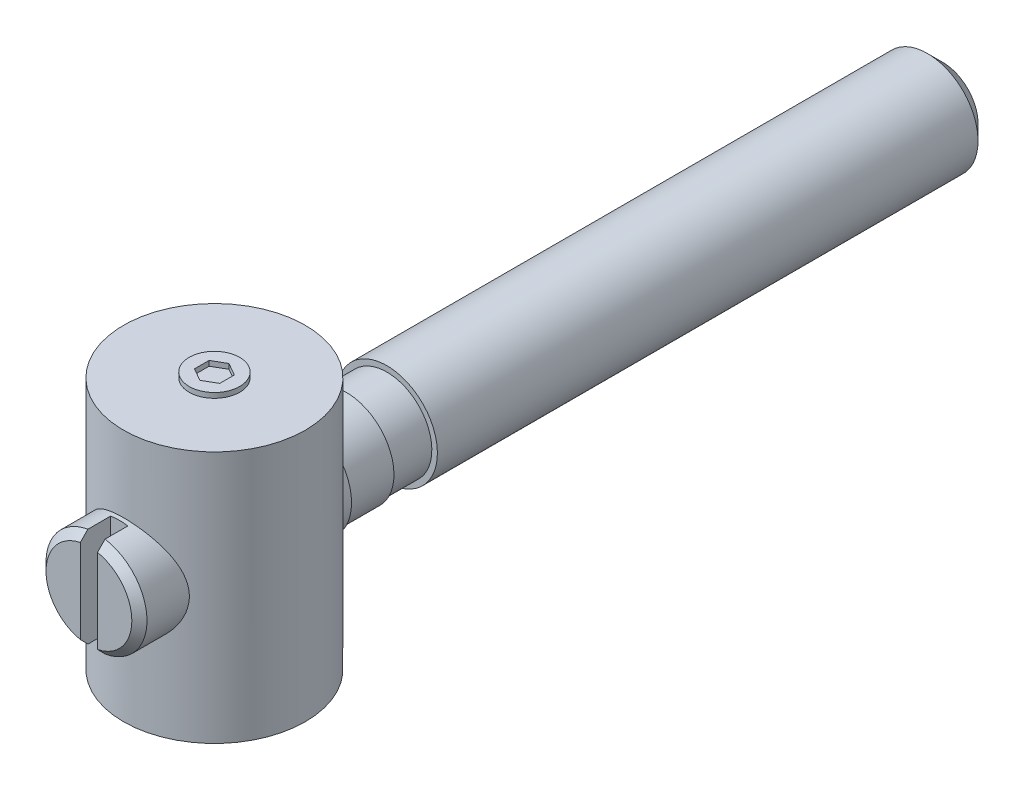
ISO-10303-21;
HEADER;
FILE_DESCRIPTION(('STEP AP214'),'2;1');
FILE_NAME('part.step','',(''),(''),'','','');
FILE_SCHEMA(('AUTOMOTIVE_DESIGN { 1 0 10303 214 1 1 1 1 }'));
ENDSEC;
DATA;
#1=APPLICATION_CONTEXT('core data for automotive mechanical design processes');
#2=APPLICATION_PROTOCOL_DEFINITION('international standard','automotive_design',2000,#1);
#3=PRODUCT_CONTEXT('',#1,'mechanical');
#4=PRODUCT('Part','Part','',(#3));
#5=PRODUCT_RELATED_PRODUCT_CATEGORY('part','',(#4));
#6=PRODUCT_DEFINITION_FORMATION('','',#4);
#7=PRODUCT_DEFINITION_CONTEXT('part definition',#1,'design');
#8=PRODUCT_DEFINITION('design','',#6,#7);
#9=PRODUCT_DEFINITION_SHAPE('','',#8);
#10=(LENGTH_UNIT() NAMED_UNIT(*) SI_UNIT(.MILLI.,.METRE.));
#11=(NAMED_UNIT(*) PLANE_ANGLE_UNIT() SI_UNIT($,.RADIAN.));
#12=(NAMED_UNIT(*) SI_UNIT($,.STERADIAN.) SOLID_ANGLE_UNIT());
#13=UNCERTAINTY_MEASURE_WITH_UNIT(LENGTH_MEASURE(1.E-05),#10,'distance_accuracy_value','');
#14=(GEOMETRIC_REPRESENTATION_CONTEXT(3) GLOBAL_UNCERTAINTY_ASSIGNED_CONTEXT((#13)) GLOBAL_UNIT_ASSIGNED_CONTEXT((#10,
#11,#12)) REPRESENTATION_CONTEXT('',''));
#15=CARTESIAN_POINT('',(0.,0.,0.));
#16=DIRECTION('',(0.,0.,1.));
#17=DIRECTION('',(1.,0.,0.));
#18=AXIS2_PLACEMENT_3D('',#15,#16,#17);
#19=CARTESIAN_POINT('',(0.,0.,12.4245));
#20=DIRECTION('',(0.,0.,-1.));
#21=DIRECTION('',(0.,1.,0.));
#22=AXIS2_PLACEMENT_3D('',#19,#20,#21);
#23=PLANE('',#22);
#24=CARTESIAN_POINT('',(0.,0.,12.4245));
#25=DIRECTION('',(0.,0.,-1.));
#26=DIRECTION('',(0.,1.,0.));
#27=AXIS2_PLACEMENT_3D('',#24,#25,#26);
#28=CIRCLE('',#27,4.25);
#29=CARTESIAN_POINT('',(0.85,-4.16413256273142,12.4245));
#30=VERTEX_POINT('',#29);
#31=CARTESIAN_POINT('',(0.85,4.16413256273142,12.4245));
#32=VERTEX_POINT('',#31);
#33=EDGE_CURVE('E175',#30,#32,#28,.F.);
#34=ORIENTED_EDGE('',*,*,#33,.T.);
#35=DIRECTION('',(0.,1.,0.));
#36=VECTOR('',#35,1.);
#37=CARTESIAN_POINT('',(0.85,4.92722031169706,12.4245));
#38=LINE('',#37,#36);
#39=EDGE_CURVE('E353',#30,#32,#38,.T.);
#40=ORIENTED_EDGE('',*,*,#39,.F.);
#41=EDGE_LOOP('',(#34,#40));
#42=FACE_BOUND('',#41,.T.);
#43=ADVANCED_FACE('F14',(#42),#23,.F.);
#44=CARTESIAN_POINT('',(-0.85,4.16413256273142,12.4245));
#45=VERTEX_POINT('',#44);
#46=CARTESIAN_POINT('',(-0.85,-4.16413256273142,12.4245));
#47=VERTEX_POINT('',#46);
#48=EDGE_CURVE('E176',#45,#47,#28,.F.);
#49=ORIENTED_EDGE('',*,*,#48,.T.);
#50=DIRECTION('',(0.,-1.,0.));
#51=VECTOR('',#50,1.);
#52=CARTESIAN_POINT('',(-0.85,4.92722031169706,12.4245));
#53=LINE('',#52,#51);
#54=EDGE_CURVE('E408',#45,#47,#53,.T.);
#55=ORIENTED_EDGE('',*,*,#54,.F.);
#56=EDGE_LOOP('',(#49,#55));
#57=FACE_BOUND('',#56,.T.);
#58=ADVANCED_FACE('F213',(#57),#23,.F.);
#59=CARTESIAN_POINT('',(0.,0.,12.4245));
#60=DIRECTION('',(0.,0.,-1.));
#61=DIRECTION('',(0.,1.,0.));
#62=AXIS2_PLACEMENT_3D('',#59,#60,#61);
#63=CONICAL_SURFACE('',#62,4.25,0.785398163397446);
#64=CARTESIAN_POINT('',(0.85,-10.8571842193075,5.7840937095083));
#65=CARTESIAN_POINT('',(0.850000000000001,-10.471658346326,6.16843314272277));
#66=CARTESIAN_POINT('',(0.850000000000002,-10.0860798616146,6.55271985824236));
#67=CARTESIAN_POINT('',(0.850000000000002,-9.31472993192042,7.32113134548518));
#68=CARTESIAN_POINT('',(0.850000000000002,-8.92895847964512,7.70525610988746));
#69=CARTESIAN_POINT('',(0.850000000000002,-8.15678249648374,8.47363775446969));
#70=CARTESIAN_POINT('',(0.850000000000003,-7.7703777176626,8.85789438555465));
#71=CARTESIAN_POINT('',(0.850000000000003,-6.99719715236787,9.62600327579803));
#72=CARTESIAN_POINT('',(0.850000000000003,-6.61042138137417,10.0098555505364));
#73=CARTESIAN_POINT('',(0.850000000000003,-5.85479041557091,10.7585441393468));
#74=CARTESIAN_POINT('',(0.850000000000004,-5.48596470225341,11.1234101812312));
#75=CARTESIAN_POINT('',(0.850000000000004,-4.93193044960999,11.6699477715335));
#76=CARTESIAN_POINT('',(0.850000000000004,-4.7471085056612,11.8520110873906));
#77=CARTESIAN_POINT('',(0.850000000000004,-4.37709943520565,12.21576213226));
#78=CARTESIAN_POINT('',(0.850000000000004,-4.19191231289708,12.3974498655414));
#79=CARTESIAN_POINT('',(0.850000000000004,-3.82111814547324,12.7601731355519));
#80=CARTESIAN_POINT('',(0.850000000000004,-3.63551142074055,12.94120899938));
#81=CARTESIAN_POINT('',(0.850000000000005,-3.26347010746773,13.3024446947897));
#82=CARTESIAN_POINT('',(0.850000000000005,-3.07703548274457,13.4826444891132));
#83=CARTESIAN_POINT('',(0.850000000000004,-2.70287506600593,13.8416259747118));
#84=CARTESIAN_POINT('',(0.850000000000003,-2.51514955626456,14.0204079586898));
#85=CARTESIAN_POINT('',(0.850000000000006,-2.23171685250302,14.2866057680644));
#86=CARTESIAN_POINT('',(0.850000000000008,-2.13693525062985,14.3750060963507));
#87=CARTESIAN_POINT('',(0.850000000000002,-1.94648080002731,14.5508404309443));
#88=CARTESIAN_POINT('',(0.849999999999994,-1.85080797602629,14.6382744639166));
#89=CARTESIAN_POINT('',(0.850000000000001,-1.72767566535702,14.7490832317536));
#90=CARTESIAN_POINT('',(0.850000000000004,-1.70082923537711,14.7731393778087));
#91=CARTESIAN_POINT('',(0.850000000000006,-1.64701809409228,14.8211193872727));
#92=CARTESIAN_POINT('',(0.850000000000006,-1.6200533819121,14.8450432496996));
#93=CARTESIAN_POINT('',(0.850000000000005,-1.53895497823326,14.9165942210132));
#94=CARTESIAN_POINT('',(0.850000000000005,-1.48462201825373,14.9639962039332));
#95=CARTESIAN_POINT('',(0.850000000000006,-1.37483312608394,15.0583713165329));
#96=CARTESIAN_POINT('',(0.850000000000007,-1.31937170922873,15.1053380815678));
#97=CARTESIAN_POINT('',(0.850000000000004,-1.20752807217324,15.1981369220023));
#98=CARTESIAN_POINT('',(0.85,-1.15114610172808,15.2439692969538));
#99=CARTESIAN_POINT('',(0.85,-1.03663150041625,15.3344042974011));
#100=CARTESIAN_POINT('',(0.850000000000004,-0.978488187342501,15.3789934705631));
#101=CARTESIAN_POINT('',(0.850000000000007,-0.860303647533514,15.4657790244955));
#102=CARTESIAN_POINT('',(0.850000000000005,-0.800260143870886,15.5079723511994));
#103=CARTESIAN_POINT('',(0.850000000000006,-0.67804689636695,15.5881646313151));
#104=CARTESIAN_POINT('',(0.850000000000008,-0.615896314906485,15.6261924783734));
#105=CARTESIAN_POINT('',(0.850000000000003,-0.488100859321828,15.6957876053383));
#106=CARTESIAN_POINT('',(0.849999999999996,-0.42246662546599,15.7273732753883));
#107=CARTESIAN_POINT('',(0.850000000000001,-0.329088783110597,15.763320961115));
#108=CARTESIAN_POINT('',(0.850000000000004,-0.303167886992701,15.7723966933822));
#109=CARTESIAN_POINT('',(0.850000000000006,-0.250726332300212,15.7886439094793));
#110=CARTESIAN_POINT('',(0.850000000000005,-0.224205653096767,15.795815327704));
#111=CARTESIAN_POINT('',(0.850000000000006,-0.170756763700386,15.8079066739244));
#112=CARTESIAN_POINT('',(0.850000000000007,-0.143830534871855,15.8128352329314));
#113=CARTESIAN_POINT('',(0.850000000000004,-0.089641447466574,15.820207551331));
#114=CARTESIAN_POINT('',(0.85,-0.0623786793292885,15.822651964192));
#115=CARTESIAN_POINT('',(0.85,-0.00753726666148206,15.824910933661));
#116=CARTESIAN_POINT('',(0.850000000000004,0.0200422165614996,15.82470572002));
#117=CARTESIAN_POINT('',(0.850000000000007,0.0750465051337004,15.8216369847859));
#118=CARTESIAN_POINT('',(0.850000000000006,0.102471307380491,15.8187734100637));
#119=CARTESIAN_POINT('',(0.850000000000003,0.184310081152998,15.8064148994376));
#120=CARTESIAN_POINT('',(0.85,0.238169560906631,15.7931483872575));
#121=CARTESIAN_POINT('',(0.85,0.341986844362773,15.7595828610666));
#122=CARTESIAN_POINT('',(0.850000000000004,0.392008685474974,15.7394689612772));
#123=CARTESIAN_POINT('',(0.850000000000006,0.489870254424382,15.6944042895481));
#124=CARTESIAN_POINT('',(0.850000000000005,0.53770609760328,15.6694452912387));
#125=CARTESIAN_POINT('',(0.850000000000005,0.631894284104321,15.616071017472));
#126=CARTESIAN_POINT('',(0.850000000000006,0.678231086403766,15.5876288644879));
#127=CARTESIAN_POINT('',(0.850000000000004,0.769393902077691,15.5285213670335));
#128=CARTESIAN_POINT('',(0.85,0.814221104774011,15.4978578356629));
#129=CARTESIAN_POINT('',(0.85,0.906418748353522,15.4323418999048));
#130=CARTESIAN_POINT('',(0.850000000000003,0.95369151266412,15.3973530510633));
#131=CARTESIAN_POINT('',(0.850000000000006,1.04723694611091,15.3260585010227));
#132=CARTESIAN_POINT('',(0.850000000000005,1.09350947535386,15.2897526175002));
#133=CARTESIAN_POINT('',(0.850000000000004,1.23123275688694,15.1793793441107));
#134=CARTESIAN_POINT('',(0.850000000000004,1.32154148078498,15.1038914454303));
#135=CARTESIAN_POINT('',(0.850000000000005,1.50045598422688,14.9506177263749));
#136=CARTESIAN_POINT('',(0.850000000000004,1.58905825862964,14.8728278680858));
#137=CARTESIAN_POINT('',(0.850000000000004,1.76500186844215,14.7158903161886));
#138=CARTESIAN_POINT('',(0.850000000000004,1.85234357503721,14.6367430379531));
#139=CARTESIAN_POINT('',(0.850000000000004,2.02593043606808,14.4777547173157));
#140=CARTESIAN_POINT('',(0.850000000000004,2.11217801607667,14.3979163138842));
#141=CARTESIAN_POINT('',(0.850000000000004,2.28407604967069,14.2375871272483));
#142=CARTESIAN_POINT('',(0.850000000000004,2.3697264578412,14.1570962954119));
#143=CARTESIAN_POINT('',(0.850000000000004,2.54048363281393,13.9957355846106));
#144=CARTESIAN_POINT('',(0.850000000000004,2.62559090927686,13.9148662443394));
#145=CARTESIAN_POINT('',(0.850000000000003,2.79546438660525,13.7527747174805));
#146=CARTESIAN_POINT('',(0.850000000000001,2.8802305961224,13.6715525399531));
#147=CARTESIAN_POINT('',(0.849999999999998,3.13203787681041,13.4295009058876));
#148=CARTESIAN_POINT('',(0.850000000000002,3.29870204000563,13.2682794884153));
#149=CARTESIAN_POINT('',(0.850000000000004,3.63138320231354,12.9451699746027));
#150=CARTESIAN_POINT('',(0.850000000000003,3.79740019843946,12.7832818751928));
#151=CARTESIAN_POINT('',(0.850000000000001,4.29480941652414,12.2969477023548));
#152=CARTESIAN_POINT('',(0.850000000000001,4.62555293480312,11.9718384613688));
#153=CARTESIAN_POINT('',(0.850000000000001,5.28633819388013,11.3205425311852));
#154=CARTESIAN_POINT('',(0.850000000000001,5.6163794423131,10.9943553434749));
#155=CARTESIAN_POINT('',(0.85,6.27592616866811,10.3414463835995));
#156=CARTESIAN_POINT('',(0.85,6.60543165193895,10.0147246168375));
#157=CARTESIAN_POINT('',(0.849999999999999,7.26217149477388,9.36286110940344));
#158=CARTESIAN_POINT('',(0.849999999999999,7.58940782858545,9.03772135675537));
#159=CARTESIAN_POINT('',(0.849999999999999,8.24365487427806,8.3872127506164));
#160=CARTESIAN_POINT('',(0.849999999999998,8.57066558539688,8.06184389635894));
#161=CARTESIAN_POINT('',(0.849999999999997,9.22432804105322,7.41114429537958));
#162=CARTESIAN_POINT('',(0.849999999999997,9.55097988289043,7.08581364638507));
#163=CARTESIAN_POINT('',(0.849999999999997,10.2041625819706,6.43503329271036));
#164=CARTESIAN_POINT('',(0.849999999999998,10.5306934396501,6.10958358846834));
#165=CARTESIAN_POINT('',(0.85,10.8571842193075,5.7840937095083));
#166=B_SPLINE_CURVE_WITH_KNOTS('',3,(#64,#65,#66,#67,#68,#69,#70,#71,#72,#73,#74,#75,#76,#77,
#78,#79,#80,#81,#82,#83,#84,#85,#86,#87,#88,#89,#90,#91,#92,#93,#94,#95,#96,#97,#98,#99,#100,
#101,#102,#103,#104,#105,#106,#107,#108,#109,#110,#111,#112,#113,#114,#115,#116,#117,#118,#119,
#120,#121,#122,#123,#124,#125,#126,#127,#128,#129,#130,#131,#132,#133,#134,#135,#136,#137,#138,
#139,#140,#141,#142,#143,#144,#145,#146,#147,#148,#149,#150,#151,#152,#153,#154,#155,#156,#157,
#158,#159,#160,#161,#162,#163,#164,#165),.UNSPECIFIED.,.F.,.F.,(4,2,2,2,2,2,2,2,2,2,2,2,2,2,2,2,
2,2,2,2,2,2,2,2,2,2,2,2,2,2,2,2,2,2,2,2,2,2,2,2,2,2,2,2,2,2,2,2,2,2,4),(0.,1.63313292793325,
3.26633311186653,4.90115899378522,6.5359193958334,8.09233592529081,8.87063870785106,
9.64893259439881,10.4267573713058,11.2046164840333,11.9823105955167,12.3711302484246,
12.7599391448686,12.8680815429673,12.9762247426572,13.1925313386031,13.4105501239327,
13.6285107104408,13.8482899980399,14.06834343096,14.2867582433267,14.5045405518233,
14.5868729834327,14.6692082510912,14.7512239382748,14.8332180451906,14.9158243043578,
14.9984322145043,15.1639989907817,15.3254048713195,15.4870872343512,15.6501067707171,
15.8129947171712,15.9894007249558,16.1658312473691,16.5188698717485,16.8725695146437,
17.2261627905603,17.5787425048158,17.9313487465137,18.2835517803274,18.6357458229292,
19.3313885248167,20.0270344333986,21.4183551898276,22.8104494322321,24.2025296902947,
25.5864353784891,26.9703457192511,28.3534122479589,29.7364737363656),.UNSPECIFIED.);
#167=CARTESIAN_POINT('',(0.85,-4.92722031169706,11.6745));
#168=VERTEX_POINT('',#167);
#169=EDGE_CURVE('E191',#168,#30,#166,.T.);
#170=ORIENTED_EDGE('',*,*,#169,.F.);
#171=CARTESIAN_POINT('',(0.,0.,11.6745));
#172=DIRECTION('',(0.,0.,-1.));
#173=DIRECTION('',(0.,1.,0.));
#174=AXIS2_PLACEMENT_3D('',#171,#172,#173);
#175=CIRCLE('',#174,5.);
#176=CARTESIAN_POINT('',(0.85,4.92722031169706,11.6745));
#177=VERTEX_POINT('',#176);
#178=EDGE_CURVE('E180',#177,#168,#175,.T.);
#179=ORIENTED_EDGE('',*,*,#178,.F.);
#180=EDGE_CURVE('E183',#32,#177,#166,.T.);
#181=ORIENTED_EDGE('',*,*,#180,.F.);
#182=ORIENTED_EDGE('',*,*,#33,.F.);
#183=EDGE_LOOP('',(#170,#179,#181,#182));
#184=FACE_BOUND('',#183,.T.);
#185=ADVANCED_FACE('F199',(#184),#63,.T.);
#186=CARTESIAN_POINT('',(0.85,4.92722031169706,9.4245));
#187=DIRECTION('',(1.,0.,0.));
#188=DIRECTION('',(0.,1.,0.));
#189=AXIS2_PLACEMENT_3D('',#186,#187,#188);
#190=PLANE('',#189);
#191=ORIENTED_EDGE('',*,*,#169,.T.);
#192=ORIENTED_EDGE('',*,*,#39,.T.);
#193=ORIENTED_EDGE('',*,*,#180,.T.);
#194=DIRECTION('',(0.,0.,1.));
#195=VECTOR('',#194,1.);
#196=CARTESIAN_POINT('',(0.85,4.92722031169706,9.4245));
#197=LINE('',#196,#195);
#198=CARTESIAN_POINT('',(0.85,4.92722031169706,9.4245));
#199=VERTEX_POINT('',#198);
#200=EDGE_CURVE('E424',#199,#177,#197,.T.);
#201=ORIENTED_EDGE('',*,*,#200,.F.);
#202=DIRECTION('',(0.,1.,0.));
#203=VECTOR('',#202,1.);
#204=CARTESIAN_POINT('',(0.85,4.92722031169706,9.4245));
#205=LINE('',#204,#203);
#206=CARTESIAN_POINT('',(0.85,-4.92722031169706,9.4245));
#207=VERTEX_POINT('',#206);
#208=EDGE_CURVE('E87',#207,#199,#205,.T.);
#209=ORIENTED_EDGE('',*,*,#208,.F.);
#210=DIRECTION('',(0.,0.,1.));
#211=VECTOR('',#210,1.);
#212=CARTESIAN_POINT('',(0.85,-4.92722031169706,9.4245));
#213=LINE('',#212,#211);
#214=EDGE_CURVE('E426',#207,#168,#213,.T.);
#215=ORIENTED_EDGE('',*,*,#214,.T.);
#216=EDGE_LOOP('',(#191,#192,#193,#201,#209,#215));
#217=FACE_BOUND('',#216,.T.);
#218=ADVANCED_FACE('F203',(#217),#190,.F.);
#219=CARTESIAN_POINT('',(0.,0.,9.4245));
#220=DIRECTION('',(0.,0.,1.));
#221=DIRECTION('',(0.,-1.,0.));
#222=AXIS2_PLACEMENT_3D('',#219,#220,#221);
#223=PLANE('',#222);
#224=CARTESIAN_POINT('',(0.,0.,9.4245));
#225=DIRECTION('',(0.,0.,1.));
#226=DIRECTION('',(0.,-1.,0.));
#227=AXIS2_PLACEMENT_3D('',#224,#225,#226);
#228=CIRCLE('',#227,5.);
#229=CARTESIAN_POINT('',(-0.85,-4.92722031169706,9.4245));
#230=VERTEX_POINT('',#229);
#231=EDGE_CURVE('E412',#230,#207,#228,.T.);
#232=ORIENTED_EDGE('',*,*,#231,.T.);
#233=ORIENTED_EDGE('',*,*,#208,.T.);
#234=CARTESIAN_POINT('',(0.,0.,9.4245));
#235=DIRECTION('',(0.,0.,1.));
#236=DIRECTION('',(0.,-1.,0.));
#237=AXIS2_PLACEMENT_3D('',#234,#235,#236);
#238=CIRCLE('',#237,5.);
#239=CARTESIAN_POINT('',(-0.85,4.92722031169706,9.4245));
#240=VERTEX_POINT('',#239);
#241=EDGE_CURVE('E430',#199,#240,#238,.T.);
#242=ORIENTED_EDGE('',*,*,#241,.T.);
#243=DIRECTION('',(0.,-1.,0.));
#244=VECTOR('',#243,1.);
#245=CARTESIAN_POINT('',(-0.85,4.92722031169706,9.4245));
#246=LINE('',#245,#244);
#247=EDGE_CURVE('E415',#240,#230,#246,.T.);
#248=ORIENTED_EDGE('',*,*,#247,.T.);
#249=EDGE_LOOP('',(#232,#233,#242,#248));
#250=FACE_BOUND('',#249,.T.);
#251=ADVANCED_FACE('F207',(#250),#223,.T.);
#252=CARTESIAN_POINT('',(-0.85,4.92722031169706,9.4245));
#253=DIRECTION('',(-1.,0.,0.));
#254=DIRECTION('',(0.,-1.,0.));
#255=AXIS2_PLACEMENT_3D('',#252,#253,#254);
#256=PLANE('',#255);
#257=CARTESIAN_POINT('',(-0.85,10.8571842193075,5.7840937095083));
#258=CARTESIAN_POINT('',(-0.850000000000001,10.471658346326,6.16843314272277));
#259=CARTESIAN_POINT('',(-0.850000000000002,10.0860798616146,6.55271985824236));
#260=CARTESIAN_POINT('',(-0.850000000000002,9.31472993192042,7.32113134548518));
#261=CARTESIAN_POINT('',(-0.850000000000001,8.92895847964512,7.70525610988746));
#262=CARTESIAN_POINT('',(-0.850000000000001,8.15678249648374,8.47363775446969));
#263=CARTESIAN_POINT('',(-0.85,7.77037771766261,8.85789438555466));
#264=CARTESIAN_POINT('',(-0.85,6.99719715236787,9.62600327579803));
#265=CARTESIAN_POINT('',(-0.85,6.61042138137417,10.0098555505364));
#266=CARTESIAN_POINT('',(-0.849999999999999,5.85479041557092,10.7585441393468));
#267=CARTESIAN_POINT('',(-0.849999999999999,5.48596470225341,11.1234101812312));
#268=CARTESIAN_POINT('',(-0.849999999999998,4.93193044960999,11.6699477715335));
#269=CARTESIAN_POINT('',(-0.849999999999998,4.7471085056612,11.8520110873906));
#270=CARTESIAN_POINT('',(-0.849999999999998,4.37709943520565,12.21576213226));
#271=CARTESIAN_POINT('',(-0.849999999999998,4.19191231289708,12.3974498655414));
#272=CARTESIAN_POINT('',(-0.849999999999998,3.82111814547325,12.7601731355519));
#273=CARTESIAN_POINT('',(-0.849999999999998,3.63551142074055,12.94120899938));
#274=CARTESIAN_POINT('',(-0.849999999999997,3.26347010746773,13.3024446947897));
#275=CARTESIAN_POINT('',(-0.849999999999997,3.07703548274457,13.4826444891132));
#276=CARTESIAN_POINT('',(-0.849999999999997,2.70287506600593,13.8416259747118));
#277=CARTESIAN_POINT('',(-0.849999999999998,2.51514955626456,14.0204079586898));
#278=CARTESIAN_POINT('',(-0.849999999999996,2.23171685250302,14.2866057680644));
#279=CARTESIAN_POINT('',(-0.849999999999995,2.13693525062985,14.3750060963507));
#280=CARTESIAN_POINT('',(-0.849999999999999,1.94648080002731,14.5508404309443));
#281=CARTESIAN_POINT('',(-0.850000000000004,1.85080797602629,14.6382744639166));
#282=CARTESIAN_POINT('',(-0.849999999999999,1.72767566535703,14.7490832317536));
#283=CARTESIAN_POINT('',(-0.849999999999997,1.70082923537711,14.7731393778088));
#284=CARTESIAN_POINT('',(-0.849999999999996,1.64701809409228,14.8211193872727));
#285=CARTESIAN_POINT('',(-0.849999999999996,1.6200533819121,14.8450432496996));
#286=CARTESIAN_POINT('',(-0.849999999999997,1.53895497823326,14.9165942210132));
#287=CARTESIAN_POINT('',(-0.849999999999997,1.48462201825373,14.9639962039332));
#288=CARTESIAN_POINT('',(-0.849999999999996,1.37483312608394,15.0583713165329));
#289=CARTESIAN_POINT('',(-0.849999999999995,1.31937170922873,15.1053380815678));
#290=CARTESIAN_POINT('',(-0.849999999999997,1.20752807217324,15.1981369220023));
#291=CARTESIAN_POINT('',(-0.85,1.15114610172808,15.2439692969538));
#292=CARTESIAN_POINT('',(-0.85,1.03663150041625,15.3344042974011));
#293=CARTESIAN_POINT('',(-0.849999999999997,0.978488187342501,15.3789934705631));
#294=CARTESIAN_POINT('',(-0.849999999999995,0.860303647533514,15.4657790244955));
#295=CARTESIAN_POINT('',(-0.849999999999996,0.800260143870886,15.5079723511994));
#296=CARTESIAN_POINT('',(-0.849999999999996,0.67804689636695,15.5881646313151));
#297=CARTESIAN_POINT('',(-0.849999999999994,0.615896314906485,15.6261924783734));
#298=CARTESIAN_POINT('',(-0.849999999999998,0.488100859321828,15.6957876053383));
#299=CARTESIAN_POINT('',(-0.850000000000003,0.42246662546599,15.7273732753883));
#300=CARTESIAN_POINT('',(-0.849999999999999,0.329088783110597,15.763320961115));
#301=CARTESIAN_POINT('',(-0.849999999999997,0.303167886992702,15.7723966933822));
#302=CARTESIAN_POINT('',(-0.849999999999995,0.250726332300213,15.7886439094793));
#303=CARTESIAN_POINT('',(-0.849999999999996,0.224205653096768,15.795815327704));
#304=CARTESIAN_POINT('',(-0.849999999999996,0.170756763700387,15.8079066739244));
#305=CARTESIAN_POINT('',(-0.849999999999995,0.143830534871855,15.8128352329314));
#306=CARTESIAN_POINT('',(-0.849999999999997,0.0896414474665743,15.820207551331));
#307=CARTESIAN_POINT('',(-0.85,0.0623786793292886,15.822651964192));
#308=CARTESIAN_POINT('',(-0.85,0.00753726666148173,15.824910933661));
#309=CARTESIAN_POINT('',(-0.849999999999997,-0.0200422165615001,15.82470572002));
#310=CARTESIAN_POINT('',(-0.849999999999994,-0.0750465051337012,15.8216369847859));
#311=CARTESIAN_POINT('',(-0.849999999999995,-0.102471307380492,15.8187734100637));
#312=CARTESIAN_POINT('',(-0.849999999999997,-0.184310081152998,15.8064148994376));
#313=CARTESIAN_POINT('',(-0.85,-0.238169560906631,15.7931483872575));
#314=CARTESIAN_POINT('',(-0.85,-0.341986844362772,15.7595828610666));
#315=CARTESIAN_POINT('',(-0.849999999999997,-0.392008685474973,15.7394689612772));
#316=CARTESIAN_POINT('',(-0.849999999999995,-0.489870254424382,15.6944042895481));
#317=CARTESIAN_POINT('',(-0.849999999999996,-0.537706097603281,15.6694452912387));
#318=CARTESIAN_POINT('',(-0.849999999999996,-0.631894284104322,15.616071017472));
#319=CARTESIAN_POINT('',(-0.849999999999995,-0.678231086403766,15.5876288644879));
#320=CARTESIAN_POINT('',(-0.849999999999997,-0.769393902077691,15.5285213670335));
#321=CARTESIAN_POINT('',(-0.85,-0.81422110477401,15.4978578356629));
#322=CARTESIAN_POINT('',(-0.85,-0.906418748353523,15.4323418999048));
#323=CARTESIAN_POINT('',(-0.849999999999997,-0.953691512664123,15.3973530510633));
#324=CARTESIAN_POINT('',(-0.849999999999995,-1.04723694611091,15.3260585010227));
#325=CARTESIAN_POINT('',(-0.849999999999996,-1.09350947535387,15.2897526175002));
#326=CARTESIAN_POINT('',(-0.849999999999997,-1.23123275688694,15.1793793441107));
#327=CARTESIAN_POINT('',(-0.849999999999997,-1.32154148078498,15.1038914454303));
#328=CARTESIAN_POINT('',(-0.849999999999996,-1.50045598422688,14.9506177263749));
#329=CARTESIAN_POINT('',(-0.849999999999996,-1.58905825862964,14.8728278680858));
#330=CARTESIAN_POINT('',(-0.849999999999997,-1.76500186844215,14.7158903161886));
#331=CARTESIAN_POINT('',(-0.849999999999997,-1.85234357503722,14.6367430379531));
#332=CARTESIAN_POINT('',(-0.849999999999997,-2.02593043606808,14.4777547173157));
#333=CARTESIAN_POINT('',(-0.849999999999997,-2.11217801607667,14.3979163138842));
#334=CARTESIAN_POINT('',(-0.849999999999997,-2.28407604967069,14.2375871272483));
#335=CARTESIAN_POINT('',(-0.849999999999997,-2.3697264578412,14.1570962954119));
#336=CARTESIAN_POINT('',(-0.849999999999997,-2.54048363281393,13.9957355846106));
#337=CARTESIAN_POINT('',(-0.849999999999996,-2.62559090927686,13.9148662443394));
#338=CARTESIAN_POINT('',(-0.849999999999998,-2.79546438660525,13.7527747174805));
#339=CARTESIAN_POINT('',(-0.849999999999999,-2.8802305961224,13.6715525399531));
#340=CARTESIAN_POINT('',(-0.850000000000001,-3.13203787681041,13.4295009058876));
#341=CARTESIAN_POINT('',(-0.849999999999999,-3.29870204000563,13.2682794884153));
#342=CARTESIAN_POINT('',(-0.849999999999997,-3.63138320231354,12.9451699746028));
#343=CARTESIAN_POINT('',(-0.849999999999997,-3.79740019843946,12.7832818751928));
#344=CARTESIAN_POINT('',(-0.849999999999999,-4.29480941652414,12.2969477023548));
#345=CARTESIAN_POINT('',(-0.849999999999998,-4.62555293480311,11.9718384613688));
#346=CARTESIAN_POINT('',(-0.849999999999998,-5.28633819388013,11.3205425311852));
#347=CARTESIAN_POINT('',(-0.849999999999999,-5.6163794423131,10.9943553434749));
#348=CARTESIAN_POINT('',(-0.849999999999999,-6.27592616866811,10.3414463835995));
#349=CARTESIAN_POINT('',(-0.85,-6.60543165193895,10.0147246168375));
#350=CARTESIAN_POINT('',(-0.85,-7.26217149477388,9.36286110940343));
#351=CARTESIAN_POINT('',(-0.85,-7.58940782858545,9.03772135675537));
#352=CARTESIAN_POINT('',(-0.850000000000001,-8.24365487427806,8.38721275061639));
#353=CARTESIAN_POINT('',(-0.850000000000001,-8.57066558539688,8.06184389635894));
#354=CARTESIAN_POINT('',(-0.850000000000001,-9.22432804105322,7.41114429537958));
#355=CARTESIAN_POINT('',(-0.850000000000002,-9.55097988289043,7.08581364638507));
#356=CARTESIAN_POINT('',(-0.850000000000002,-10.2041625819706,6.43503329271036));
#357=CARTESIAN_POINT('',(-0.850000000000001,-10.5306934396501,6.10958358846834));
#358=CARTESIAN_POINT('',(-0.85,-10.8571842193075,5.7840937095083));
#359=B_SPLINE_CURVE_WITH_KNOTS('',3,(#257,#258,#259,#260,#261,#262,#263,#264,#265,#266,#267,
#268,#269,#270,#271,#272,#273,#274,#275,#276,#277,#278,#279,#280,#281,#282,#283,#284,#285,#286,
#287,#288,#289,#290,#291,#292,#293,#294,#295,#296,#297,#298,#299,#300,#301,#302,#303,#304,#305,
#306,#307,#308,#309,#310,#311,#312,#313,#314,#315,#316,#317,#318,#319,#320,#321,#322,#323,#324,
#325,#326,#327,#328,#329,#330,#331,#332,#333,#334,#335,#336,#337,#338,#339,#340,#341,#342,#343,
#344,#345,#346,#347,#348,#349,#350,#351,#352,#353,#354,#355,#356,#357,#358),.UNSPECIFIED.,.F.,
.F.,(4,2,2,2,2,2,2,2,2,2,2,2,2,2,2,2,2,2,2,2,2,2,2,2,2,2,2,2,2,2,2,2,2,2,2,2,2,2,2,2,2,2,2,2,2,
2,2,2,2,2,4),(0.,1.63313292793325,3.26633311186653,4.90115899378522,6.5359193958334,
8.09233592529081,8.87063870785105,9.6489325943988,10.4267573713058,11.2046164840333,
11.9823105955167,12.3711302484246,12.7599391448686,12.8680815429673,12.9762247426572,
13.1925313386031,13.4105501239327,13.6285107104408,13.8482899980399,14.06834343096,
14.2867582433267,14.5045405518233,14.5868729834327,14.6692082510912,14.7512239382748,
14.8332180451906,14.9158243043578,14.9984322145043,15.1639989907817,15.3254048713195,
15.4870872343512,15.6501067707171,15.8129947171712,15.9894007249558,16.1658312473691,
16.5188698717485,16.8725695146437,17.2261627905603,17.5787425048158,17.9313487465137,
18.2835517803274,18.6357458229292,19.3313885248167,20.0270344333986,21.4183551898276,
22.8104494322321,24.2025296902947,25.5864353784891,26.9703457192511,28.3534122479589,
29.7364737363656),.UNSPECIFIED.);
#360=CARTESIAN_POINT('',(-0.85,4.92722031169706,11.6745));
#361=VERTEX_POINT('',#360);
#362=EDGE_CURVE('E443',#361,#45,#359,.T.);
#363=ORIENTED_EDGE('',*,*,#362,.T.);
#364=ORIENTED_EDGE('',*,*,#54,.T.);
#365=CARTESIAN_POINT('',(-0.85,-4.92722031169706,11.6745));
#366=VERTEX_POINT('',#365);
#367=EDGE_CURVE('E192',#47,#366,#359,.T.);
#368=ORIENTED_EDGE('',*,*,#367,.T.);
#369=DIRECTION('',(0.,0.,1.));
#370=VECTOR('',#369,1.);
#371=CARTESIAN_POINT('',(-0.85,-4.92722031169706,9.4245));
#372=LINE('',#371,#370);
#373=EDGE_CURVE('E418',#230,#366,#372,.T.);
#374=ORIENTED_EDGE('',*,*,#373,.F.);
#375=ORIENTED_EDGE('',*,*,#247,.F.);
#376=DIRECTION('',(0.,0.,1.));
#377=VECTOR('',#376,1.);
#378=CARTESIAN_POINT('',(-0.85,4.92722031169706,9.4245));
#379=LINE('',#378,#377);
#380=EDGE_CURVE('E422',#240,#361,#379,.T.);
#381=ORIENTED_EDGE('',*,*,#380,.T.);
#382=EDGE_LOOP('',(#363,#364,#368,#374,#375,#381));
#383=FACE_BOUND('',#382,.T.);
#384=ADVANCED_FACE('F208',(#383),#256,.F.);
#385=ORIENTED_EDGE('',*,*,#362,.F.);
#386=EDGE_CURVE('E179',#366,#361,#175,.T.);
#387=ORIENTED_EDGE('',*,*,#386,.F.);
#388=ORIENTED_EDGE('',*,*,#367,.F.);
#389=ORIENTED_EDGE('',*,*,#48,.F.);
#390=EDGE_LOOP('',(#385,#387,#388,#389));
#391=FACE_BOUND('',#390,.T.);
#392=ADVANCED_FACE('F301',(#391),#63,.T.);
#393=CARTESIAN_POINT('',(0.,0.,42.719865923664));
#394=DIRECTION('',(0.,0.,1.));
#395=DIRECTION('',(0.,-1.,0.));
#396=AXIS2_PLACEMENT_3D('',#393,#394,#395);
#397=CYLINDRICAL_SURFACE('',#396,5.);
#398=ORIENTED_EDGE('',*,*,#386,.T.);
#399=ORIENTED_EDGE('',*,*,#380,.F.);
#400=ORIENTED_EDGE('',*,*,#241,.F.);
#401=ORIENTED_EDGE('',*,*,#200,.T.);
#402=ORIENTED_EDGE('',*,*,#178,.T.);
#403=ORIENTED_EDGE('',*,*,#214,.F.);
#404=ORIENTED_EDGE('',*,*,#231,.F.);
#405=ORIENTED_EDGE('',*,*,#373,.T.);
#406=EDGE_LOOP('',(#398,#399,#400,#401,#402,#403,#404,#405));
#407=FACE_BOUND('',#406,.T.);
#408=CARTESIAN_POINT('',(0.,-5.,9.));
#409=CARTESIAN_POINT('',(-0.129728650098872,-5.00000040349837,9.00000035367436));
#410=CARTESIAN_POINT('',(-0.259452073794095,-4.99494572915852,8.99718916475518));
#411=CARTESIAN_POINT('',(-0.517921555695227,-4.9747929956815,8.98601661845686));
#412=CARTESIAN_POINT('',(-0.646667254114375,-4.95969140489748,8.97765330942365));
#413=CARTESIAN_POINT('',(-0.902114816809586,-4.9196443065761,8.95559163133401));
#414=CARTESIAN_POINT('',(-1.02881719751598,-4.89470132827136,8.94189463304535));
#415=CARTESIAN_POINT('',(-1.27935747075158,-4.83526936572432,8.90950110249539));
#416=CARTESIAN_POINT('',(-1.40319416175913,-4.80077645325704,8.89080251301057));
#417=CARTESIAN_POINT('',(-1.64664425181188,-4.72279881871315,8.84894060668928));
#418=CARTESIAN_POINT('',(-1.76627303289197,-4.67935197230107,8.82579612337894));
#419=CARTESIAN_POINT('',(-2.00118015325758,-4.58381684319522,8.77551906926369));
#420=CARTESIAN_POINT('',(-2.11645683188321,-4.53172530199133,8.74838499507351));
#421=CARTESIAN_POINT('',(-2.45478877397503,-4.36318845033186,8.6618736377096));
#422=CARTESIAN_POINT('',(-2.67053417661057,-4.23441988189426,8.59735346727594));
#423=CARTESIAN_POINT('',(-3.09271229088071,-3.93780768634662,8.45507241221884));
#424=CARTESIAN_POINT('',(-3.29745415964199,-3.76786951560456,8.37670278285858));
#425=CARTESIAN_POINT('',(-3.67715998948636,-3.39835387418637,8.21711406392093));
#426=CARTESIAN_POINT('',(-3.85209353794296,-3.19874651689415,8.13589216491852));
#427=CARTESIAN_POINT('',(-4.18516795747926,-2.75130582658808,7.97009263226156));
#428=CARTESIAN_POINT('',(-4.33981028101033,-2.5006351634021,7.88600912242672));
#429=CARTESIAN_POINT('',(-4.53792036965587,-2.10454112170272,7.77258662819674));
#430=CARTESIAN_POINT('',(-4.59831134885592,-1.96917342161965,7.73689861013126));
#431=CARTESIAN_POINT('',(-4.70719976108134,-1.69244684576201,7.67113380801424));
#432=CARTESIAN_POINT('',(-4.75570081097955,-1.55108980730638,7.64105531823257));
#433=CARTESIAN_POINT('',(-4.86451848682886,-1.17999431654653,7.57250099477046));
#434=CARTESIAN_POINT('',(-4.9154532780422,-0.946409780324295,7.53922489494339));
#435=CARTESIAN_POINT('',(-4.98336969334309,-0.472499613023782,7.49451395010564));
#436=CARTESIAN_POINT('',(-5.00038478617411,-0.232180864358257,7.48305757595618));
#437=CARTESIAN_POINT('',(-4.99960164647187,0.248654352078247,7.48358103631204));
#438=CARTESIAN_POINT('',(-4.98176529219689,0.48917074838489,7.49558653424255));
#439=CARTESIAN_POINT('',(-4.91220969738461,0.963158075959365,7.54134329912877));
#440=CARTESIAN_POINT('',(-4.8604684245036,1.19662432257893,7.57510870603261));
#441=CARTESIAN_POINT('',(-4.725553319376,1.65086354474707,7.65998850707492));
#442=CARTESIAN_POINT('',(-4.64237249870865,1.87163368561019,7.71110675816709));
#443=CARTESIAN_POINT('',(-4.447403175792,2.29681665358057,7.82517266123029));
#444=CARTESIAN_POINT('',(-4.33560350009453,2.50122305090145,7.88812493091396));
#445=CARTESIAN_POINT('',(-4.06693738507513,2.92082028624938,8.03034742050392));
#446=CARTESIAN_POINT('',(-3.9058041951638,3.13292950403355,8.11064361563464));
#447=CARTESIAN_POINT('',(-3.55190169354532,3.52909892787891,8.27174396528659));
#448=CARTESIAN_POINT('',(-3.35910741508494,3.7131367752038,8.35254847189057));
#449=CARTESIAN_POINT('',(-3.03820334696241,3.97377961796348,8.47255594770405));
#450=CARTESIAN_POINT('',(-2.91988181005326,4.06153890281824,8.51415799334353));
#451=CARTESIAN_POINT('',(-2.67521853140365,4.22669686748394,8.59416899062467));
#452=CARTESIAN_POINT('',(-2.54887988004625,4.30409950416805,8.63257915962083));
#453=CARTESIAN_POINT('',(-2.28891079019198,4.44780208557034,8.70511911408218));
#454=CARTESIAN_POINT('',(-2.15528226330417,4.51410492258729,8.73925001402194));
#455=CARTESIAN_POINT('',(-1.88158110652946,4.63486956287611,8.8022360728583));
#456=CARTESIAN_POINT('',(-1.74150926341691,4.68933280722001,8.83109187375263));
#457=CARTESIAN_POINT('',(-1.46611496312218,4.78227003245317,8.88080389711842));
#458=CARTESIAN_POINT('',(-1.33115857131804,4.82160315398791,8.90208189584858));
#459=CARTESIAN_POINT('',(-1.05765459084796,4.88888456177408,8.93870204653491));
#460=CARTESIAN_POINT('',(-0.919107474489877,4.91683433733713,8.95404497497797));
#461=CARTESIAN_POINT('',(-0.639688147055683,4.96092635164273,8.97833234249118));
#462=CARTESIAN_POINT('',(-0.498817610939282,4.97707674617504,8.98728120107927));
#463=CARTESIAN_POINT('',(-0.215954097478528,4.99734561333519,8.99852157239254));
#464=CARTESIAN_POINT('',(-0.0739612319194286,5.00146526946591,9.00081373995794));
#465=CARTESIAN_POINT('',(0.193661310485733,4.99783122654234,8.99879540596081));
#466=CARTESIAN_POINT('',(0.31931639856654,4.99137388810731,8.99520578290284));
#467=CARTESIAN_POINT('',(0.569568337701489,4.96904196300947,8.98283315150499));
#468=CARTESIAN_POINT('',(0.694164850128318,4.9531644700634,8.97404854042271));
#469=CARTESIAN_POINT('',(0.941327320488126,4.91218729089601,8.95149651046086));
#470=CARTESIAN_POINT('',(1.06389401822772,4.88709104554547,8.93773095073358));
#471=CARTESIAN_POINT('',(1.30624674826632,4.82797111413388,8.9055432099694));
#472=CARTESIAN_POINT('',(1.42603168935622,4.7939439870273,8.88711923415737));
#473=CARTESIAN_POINT('',(1.77910695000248,4.67928639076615,8.82561614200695));
#474=CARTESIAN_POINT('',(2.00729552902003,4.58588050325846,8.77619255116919));
#475=CARTESIAN_POINT('',(2.44488800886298,4.36833983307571,8.66450874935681));
#476=CARTESIAN_POINT('',(2.65428686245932,4.24419682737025,8.60224510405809));
#477=CARTESIAN_POINT('',(3.07172957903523,3.95417802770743,8.46272453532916));
#478=CARTESIAN_POINT('',(3.27740782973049,3.78531914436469,8.38458363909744));
#479=CARTESIAN_POINT('',(3.65908152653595,3.41781320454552,8.22520611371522));
#480=CARTESIAN_POINT('',(3.83504389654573,3.21913341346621,8.14396615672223));
#481=CARTESIAN_POINT('',(4.17023823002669,2.7738769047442,7.97793731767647));
#482=CARTESIAN_POINT('',(4.32600004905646,2.52449151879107,7.89361512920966));
#483=CARTESIAN_POINT('',(4.59275891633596,1.99831062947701,7.74146523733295));
#484=CARTESIAN_POINT('',(4.70381927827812,1.7215545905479,7.67361425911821));
#485=CARTESIAN_POINT('',(4.85777774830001,1.20756607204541,7.57683809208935));
#486=CARTESIAN_POINT('',(4.91005771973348,0.974117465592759,7.5427474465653));
#487=CARTESIAN_POINT('',(4.98067851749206,0.500106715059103,7.49631291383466));
#488=CARTESIAN_POINT('',(4.99905324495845,0.259551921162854,7.48394730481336));
#489=CARTESIAN_POINT('',(5.00087641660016,-0.222043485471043,7.48272923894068));
#490=CARTESIAN_POINT('',(4.98428138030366,-0.463084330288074,7.49390605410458));
#491=CARTESIAN_POINT('',(4.91703272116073,-0.938336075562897,7.5381922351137));
#492=CARTESIAN_POINT('',(4.86635734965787,-1.17254251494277,7.57131560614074));
#493=CARTESIAN_POINT('',(4.73359019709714,-1.62763734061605,7.6550105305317));
#494=CARTESIAN_POINT('',(4.65159333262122,-1.84856365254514,7.70552932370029));
#495=CARTESIAN_POINT('',(4.45898685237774,-2.2742180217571,7.81855933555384));
#496=CARTESIAN_POINT('',(4.34836621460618,-2.47893979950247,7.88107517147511));
#497=CARTESIAN_POINT('',(4.08239378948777,-2.89911833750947,8.02246926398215));
#498=CARTESIAN_POINT('',(3.92281334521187,-3.11154387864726,8.10239358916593));
#499=CARTESIAN_POINT('',(3.5720844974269,-3.50861520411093,8.26301218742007));
#500=CARTESIAN_POINT('',(3.38091059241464,-3.69323831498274,8.34370703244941));
#501=CARTESIAN_POINT('',(3.06226198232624,-3.95526647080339,8.46388232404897));
#502=CARTESIAN_POINT('',(2.94454455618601,-4.04369106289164,8.50565265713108));
#503=CARTESIAN_POINT('',(2.7010491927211,-4.21023353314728,8.58607842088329));
#504=CARTESIAN_POINT('',(2.5752743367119,-4.28835531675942,8.62473502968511));
#505=CARTESIAN_POINT('',(2.31639114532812,-4.43354865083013,8.69784009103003));
#506=CARTESIAN_POINT('',(2.18328521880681,-4.5006238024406,8.73228991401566));
#507=CARTESIAN_POINT('',(1.91056755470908,-4.62299222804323,8.79598351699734));
#508=CARTESIAN_POINT('',(1.77095673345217,-4.67828715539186,8.82522802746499));
#509=CARTESIAN_POINT('',(1.4991287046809,-4.77193637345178,8.87524400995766));
#510=CARTESIAN_POINT('',(1.36737917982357,-4.81136832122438,8.89654158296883));
#511=CARTESIAN_POINT('',(1.10033791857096,-4.87936809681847,8.93349970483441));
#512=CARTESIAN_POINT('',(0.965046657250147,-4.90793737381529,8.94916100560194));
#513=CARTESIAN_POINT('',(0.692088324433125,-4.95380200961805,8.97439622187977));
#514=CARTESIAN_POINT('',(0.554422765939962,-4.97110429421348,8.98397387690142));
#515=CARTESIAN_POINT('',(0.277836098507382,-4.9942027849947,8.99677541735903));
#516=CARTESIAN_POINT('',(0.138915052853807,-4.99999956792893,8.9999996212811));
#517=CARTESIAN_POINT('',(0.,-5.,9.));
#518=B_SPLINE_CURVE_WITH_KNOTS('',3,(#408,#409,#410,#411,#412,#413,#414,#415,#416,#417,#418,
#419,#420,#421,#422,#423,#424,#425,#426,#427,#428,#429,#430,#431,#432,#433,#434,#435,#436,#437,
#438,#439,#440,#441,#442,#443,#444,#445,#446,#447,#448,#449,#450,#451,#452,#453,#454,#455,#456,
#457,#458,#459,#460,#461,#462,#463,#464,#465,#466,#467,#468,#469,#470,#471,#472,#473,#474,#475,
#476,#477,#478,#479,#480,#481,#482,#483,#484,#485,#486,#487,#488,#489,#490,#491,#492,#493,#494,
#495,#496,#497,#498,#499,#500,#501,#502,#503,#504,#505,#506,#507,#508,#509,#510,#511,#512,#513,
#514,#515,#516,#517),.UNSPECIFIED.,.T.,.F.,(4,2,2,2,2,2,2,2,2,2,2,2,2,2,2,2,2,2,2,2,2,2,2,2,2,2,
2,2,2,2,2,2,2,2,2,2,2,2,2,2,2,2,2,2,2,2,2,2,2,2,2,2,2,2,4),(0.,0.389049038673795,
0.778234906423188,1.1673208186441,1.5565670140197,1.94419928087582,2.33197799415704,
3.10694003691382,3.93579164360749,4.76548390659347,5.67926108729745,6.13607645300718,
6.59275268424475,7.31346839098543,8.03347261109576,8.75426483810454,9.47552592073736,
10.1969474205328,10.9186510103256,11.7500289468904,12.5820656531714,13.0407937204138,
13.4993460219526,13.9577786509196,14.4161554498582,14.8420733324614,15.2679354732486,
15.6935029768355,16.1190286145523,16.4961868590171,16.8734615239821,17.2505955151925,
17.6278750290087,18.3788772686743,19.1300806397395,19.9587345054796,20.7883047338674,
21.7014293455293,22.613256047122,23.335047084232,24.0561160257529,24.778082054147,
25.5005092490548,26.2207643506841,26.9412972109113,27.7704094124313,28.6001941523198,
29.0588132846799,29.5172580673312,29.9755531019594,30.4337837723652,30.8507153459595,
31.2675912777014,31.6842107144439,32.1008092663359),.UNSPECIFIED.);
#519=CARTESIAN_POINT('',(0.,-5.,9.));
#520=VERTEX_POINT('',#519);
#521=EDGE_CURVE('E226',#520,#520,#518,.T.);
#522=ORIENTED_EDGE('',*,*,#521,.F.);
#523=EDGE_LOOP('',(#522));
#524=FACE_BOUND('',#523,.T.);
#525=ADVANCED_FACE('F222',(#407,#524),#397,.T.);
#526=CARTESIAN_POINT('',(0.,12.5,0.));
#527=DIRECTION('',(0.,1.,0.));
#528=DIRECTION('',(1.,0.,0.));
#529=AXIS2_PLACEMENT_3D('',#526,#527,#528);
#530=PLANE('',#529);
#531=DIRECTION('',(0.,0.,-1.));
#532=VECTOR('',#531,1.);
#533=CARTESIAN_POINT('',(-1.25,12.5,-0.721687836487));
#534=LINE('',#533,#532);
#535=CARTESIAN_POINT('',(-1.25,12.5,0.72168783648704));
#536=VERTEX_POINT('',#535);
#537=CARTESIAN_POINT('',(-1.25,12.5,-0.721687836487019));
#538=VERTEX_POINT('',#537);
#539=EDGE_CURVE('E342',#536,#538,#534,.T.);
#540=ORIENTED_EDGE('',*,*,#539,.F.);
#541=DIRECTION('',(-0.866025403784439,0.,-0.5));
#542=VECTOR('',#541,1.);
#543=CARTESIAN_POINT('',(-1.25,12.5,0.72168783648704));
#544=LINE('',#543,#542);
#545=CARTESIAN_POINT('',(0.,12.5,1.4433756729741));
#546=VERTEX_POINT('',#545);
#547=EDGE_CURVE('E347',#546,#536,#544,.T.);
#548=ORIENTED_EDGE('',*,*,#547,.F.);
#549=DIRECTION('',(-0.866025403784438,0.,0.5));
#550=VECTOR('',#549,1.);
#551=CARTESIAN_POINT('',(0.,12.5,1.4433756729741));
#552=LINE('',#551,#550);
#553=CARTESIAN_POINT('',(1.25,12.5,0.72168783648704));
#554=VERTEX_POINT('',#553);
#555=EDGE_CURVE('E385',#554,#546,#552,.T.);
#556=ORIENTED_EDGE('',*,*,#555,.F.);
#557=DIRECTION('',(0.,0.,1.));
#558=VECTOR('',#557,1.);
#559=CARTESIAN_POINT('',(1.25,12.5,0.72168783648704));
#560=LINE('',#559,#558);
#561=CARTESIAN_POINT('',(1.25,12.5,-0.721687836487));
#562=VERTEX_POINT('',#561);
#563=EDGE_CURVE('E388',#562,#554,#560,.T.);
#564=ORIENTED_EDGE('',*,*,#563,.F.);
#565=DIRECTION('',(0.866025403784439,0.,0.5));
#566=VECTOR('',#565,1.);
#567=CARTESIAN_POINT('',(1.25,12.5,-0.721687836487));
#568=LINE('',#567,#566);
#569=CARTESIAN_POINT('',(0.,12.5,-1.44337567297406));
#570=VERTEX_POINT('',#569);
#571=EDGE_CURVE('E79',#570,#562,#568,.T.);
#572=ORIENTED_EDGE('',*,*,#571,.F.);
#573=DIRECTION('',(0.866025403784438,0.,-0.5));
#574=VECTOR('',#573,1.);
#575=CARTESIAN_POINT('',(0.,12.5,-1.44337567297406));
#576=LINE('',#575,#574);
#577=EDGE_CURVE('E391',#538,#570,#576,.T.);
#578=ORIENTED_EDGE('',*,*,#577,.F.);
#579=EDGE_LOOP('',(#540,#548,#556,#564,#572,#578));
#580=FACE_BOUND('',#579,.T.);
#581=ADVANCED_FACE('F290',(#580),#530,.T.);
#582=CARTESIAN_POINT('',(-1.25,11.,-0.721687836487));
#583=DIRECTION('',(-1.,0.,0.));
#584=DIRECTION('',(0.,0.,1.));
#585=AXIS2_PLACEMENT_3D('',#582,#583,#584);
#586=PLANE('',#585);
#587=DIRECTION('',(0.,1.,0.));
#588=VECTOR('',#587,1.);
#589=CARTESIAN_POINT('',(-1.25,11.,0.72168783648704));
#590=LINE('',#589,#588);
#591=CARTESIAN_POINT('',(-1.25,13.,0.72168783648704));
#592=VERTEX_POINT('',#591);
#593=EDGE_CURVE('E362',#536,#592,#590,.T.);
#594=ORIENTED_EDGE('',*,*,#593,.F.);
#595=ORIENTED_EDGE('',*,*,#539,.T.);
#596=DIRECTION('',(0.,1.,0.));
#597=VECTOR('',#596,1.);
#598=CARTESIAN_POINT('',(-1.25,11.,-0.721687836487));
#599=LINE('',#598,#597);
#600=CARTESIAN_POINT('',(-1.25,13.,-0.721687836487));
#601=VERTEX_POINT('',#600);
#602=EDGE_CURVE('E359',#538,#601,#599,.T.);
#603=ORIENTED_EDGE('',*,*,#602,.T.);
#604=DIRECTION('',(0.,0.,1.));
#605=VECTOR('',#604,1.);
#606=CARTESIAN_POINT('',(-1.25,13.,-0.721687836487));
#607=LINE('',#606,#605);
#608=EDGE_CURVE('E377',#601,#592,#607,.T.);
#609=ORIENTED_EDGE('',*,*,#608,.T.);
#610=EDGE_LOOP('',(#594,#595,#603,#609));
#611=FACE_BOUND('',#610,.T.);
#612=ADVANCED_FACE('F292',(#611),#586,.F.);
#613=CARTESIAN_POINT('',(-1.25,11.,0.72168783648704));
#614=DIRECTION('',(-0.5,0.,0.866025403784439));
#615=DIRECTION('',(0.866025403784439,0.,0.5));
#616=AXIS2_PLACEMENT_3D('',#613,#614,#615);
#617=PLANE('',#616);
#618=DIRECTION('',(0.,1.,0.));
#619=VECTOR('',#618,1.);
#620=CARTESIAN_POINT('',(0.,11.,1.4433756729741));
#621=LINE('',#620,#619);
#622=CARTESIAN_POINT('',(0.,13.,1.4433756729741));
#623=VERTEX_POINT('',#622);
#624=EDGE_CURVE('E364',#546,#623,#621,.T.);
#625=ORIENTED_EDGE('',*,*,#624,.F.);
#626=ORIENTED_EDGE('',*,*,#547,.T.);
#627=ORIENTED_EDGE('',*,*,#593,.T.);
#628=DIRECTION('',(0.866025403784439,0.,0.5));
#629=VECTOR('',#628,1.);
#630=CARTESIAN_POINT('',(-1.25,13.,0.72168783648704));
#631=LINE('',#630,#629);
#632=EDGE_CURVE('E374',#592,#623,#631,.T.);
#633=ORIENTED_EDGE('',*,*,#632,.T.);
#634=EDGE_LOOP('',(#625,#626,#627,#633));
#635=FACE_BOUND('',#634,.T.);
#636=ADVANCED_FACE('F298',(#635),#617,.F.);
#637=CARTESIAN_POINT('',(0.,11.,1.4433756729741));
#638=DIRECTION('',(0.5,0.,0.866025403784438));
#639=DIRECTION('',(0.866025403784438,0.,-0.5));
#640=AXIS2_PLACEMENT_3D('',#637,#638,#639);
#641=PLANE('',#640);
#642=DIRECTION('',(0.,1.,0.));
#643=VECTOR('',#642,1.);
#644=CARTESIAN_POINT('',(1.25,11.,0.72168783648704));
#645=LINE('',#644,#643);
#646=CARTESIAN_POINT('',(1.25,13.,0.72168783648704));
#647=VERTEX_POINT('',#646);
#648=EDGE_CURVE('E366',#554,#647,#645,.T.);
#649=ORIENTED_EDGE('',*,*,#648,.F.);
#650=ORIENTED_EDGE('',*,*,#555,.T.);
#651=ORIENTED_EDGE('',*,*,#624,.T.);
#652=DIRECTION('',(0.866025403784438,0.,-0.5));
#653=VECTOR('',#652,1.);
#654=CARTESIAN_POINT('',(0.,13.,1.4433756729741));
#655=LINE('',#654,#653);
#656=EDGE_CURVE('E371',#623,#647,#655,.T.);
#657=ORIENTED_EDGE('',*,*,#656,.T.);
#658=EDGE_LOOP('',(#649,#650,#651,#657));
#659=FACE_BOUND('',#658,.T.);
#660=ADVANCED_FACE('F308',(#659),#641,.F.);
#661=CARTESIAN_POINT('',(1.25,11.,0.72168783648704));
#662=DIRECTION('',(1.,0.,0.));
#663=DIRECTION('',(0.,0.,-1.));
#664=AXIS2_PLACEMENT_3D('',#661,#662,#663);
#665=PLANE('',#664);
#666=DIRECTION('',(0.,1.,0.));
#667=VECTOR('',#666,1.);
#668=CARTESIAN_POINT('',(1.25,11.,-0.721687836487));
#669=LINE('',#668,#667);
#670=CARTESIAN_POINT('',(1.25,13.,-0.721687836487));
#671=VERTEX_POINT('',#670);
#672=EDGE_CURVE('E357',#562,#671,#669,.T.);
#673=ORIENTED_EDGE('',*,*,#672,.F.);
#674=ORIENTED_EDGE('',*,*,#563,.T.);
#675=ORIENTED_EDGE('',*,*,#648,.T.);
#676=DIRECTION('',(0.,0.,-1.));
#677=VECTOR('',#676,1.);
#678=CARTESIAN_POINT('',(1.25,13.,0.72168783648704));
#679=LINE('',#678,#677);
#680=EDGE_CURVE('E360',#647,#671,#679,.T.);
#681=ORIENTED_EDGE('',*,*,#680,.T.);
#682=EDGE_LOOP('',(#673,#674,#675,#681));
#683=FACE_BOUND('',#682,.T.);
#684=ADVANCED_FACE('F304',(#683),#665,.F.);
#685=CARTESIAN_POINT('',(1.25,11.,-0.721687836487));
#686=DIRECTION('',(0.5,0.,-0.86602540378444));
#687=DIRECTION('',(-0.86602540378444,0.,-0.5));
#688=AXIS2_PLACEMENT_3D('',#685,#686,#687);
#689=PLANE('',#688);
#690=DIRECTION('',(0.,1.,0.));
#691=VECTOR('',#690,1.);
#692=CARTESIAN_POINT('',(0.,11.,-1.44337567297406));
#693=LINE('',#692,#691);
#694=CARTESIAN_POINT('',(0.,13.,-1.44337567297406));
#695=VERTEX_POINT('',#694);
#696=EDGE_CURVE('E73',#570,#695,#693,.T.);
#697=ORIENTED_EDGE('',*,*,#696,.F.);
#698=ORIENTED_EDGE('',*,*,#571,.T.);
#699=ORIENTED_EDGE('',*,*,#672,.T.);
#700=DIRECTION('',(-0.86602540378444,0.,-0.5));
#701=VECTOR('',#700,1.);
#702=CARTESIAN_POINT('',(1.25,13.,-0.721687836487));
#703=LINE('',#702,#701);
#704=EDGE_CURVE('E345',#671,#695,#703,.T.);
#705=ORIENTED_EDGE('',*,*,#704,.T.);
#706=EDGE_LOOP('',(#697,#698,#699,#705));
#707=FACE_BOUND('',#706,.T.);
#708=ADVANCED_FACE('F307',(#707),#689,.F.);
#709=CARTESIAN_POINT('',(0.,11.,-1.44337567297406));
#710=DIRECTION('',(-0.5,0.,-0.866025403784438));
#711=DIRECTION('',(-0.866025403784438,0.,0.5));
#712=AXIS2_PLACEMENT_3D('',#709,#710,#711);
#713=PLANE('',#712);
#714=ORIENTED_EDGE('',*,*,#602,.F.);
#715=ORIENTED_EDGE('',*,*,#577,.T.);
#716=ORIENTED_EDGE('',*,*,#696,.T.);
#717=DIRECTION('',(-0.866025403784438,0.,0.5));
#718=VECTOR('',#717,1.);
#719=CARTESIAN_POINT('',(0.,13.,-1.44337567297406));
#720=LINE('',#719,#718);
#721=EDGE_CURVE('E380',#695,#601,#720,.T.);
#722=ORIENTED_EDGE('',*,*,#721,.T.);
#723=EDGE_LOOP('',(#714,#715,#716,#722));
#724=FACE_BOUND('',#723,.T.);
#725=ADVANCED_FACE('F316',(#724),#713,.F.);
#726=CARTESIAN_POINT('',(0.,13.,0.));
#727=DIRECTION('',(0.,-1.,0.));
#728=DIRECTION('',(0.,0.,1.));
#729=AXIS2_PLACEMENT_3D('',#726,#727,#728);
#730=PLANE('',#729);
#731=ORIENTED_EDGE('',*,*,#721,.F.);
#732=ORIENTED_EDGE('',*,*,#704,.F.);
#733=ORIENTED_EDGE('',*,*,#680,.F.);
#734=ORIENTED_EDGE('',*,*,#656,.F.);
#735=ORIENTED_EDGE('',*,*,#632,.F.);
#736=ORIENTED_EDGE('',*,*,#608,.F.);
#737=EDGE_LOOP('',(#731,#732,#733,#734,#735,#736));
#738=FACE_BOUND('',#737,.T.);
#739=CARTESIAN_POINT('',(0.,13.,0.));
#740=DIRECTION('',(0.,-1.,0.));
#741=DIRECTION('',(0.,0.,1.));
#742=AXIS2_PLACEMENT_3D('',#739,#740,#741);
#743=CIRCLE('',#742,2.5);
#744=CARTESIAN_POINT('',(0.,13.,2.5));
#745=VERTEX_POINT('',#744);
#746=EDGE_CURVE('E354',#745,#745,#743,.T.);
#747=ORIENTED_EDGE('',*,*,#746,.F.);
#748=EDGE_LOOP('',(#747));
#749=FACE_BOUND('',#748,.T.);
#750=ADVANCED_FACE('F319',(#738,#749),#730,.F.);
#751=CARTESIAN_POINT('',(0.,8.,0.));
#752=DIRECTION('',(0.,-1.,0.));
#753=DIRECTION('',(0.,0.,1.));
#754=AXIS2_PLACEMENT_3D('',#751,#752,#753);
#755=CYLINDRICAL_SURFACE('',#754,2.5);
#756=ORIENTED_EDGE('',*,*,#746,.T.);
#757=EDGE_LOOP('',(#756));
#758=FACE_BOUND('',#757,.T.);
#759=CARTESIAN_POINT('',(0.,12.5,0.));
#760=DIRECTION('',(0.,-1.,0.));
#761=DIRECTION('',(0.,0.,-1.));
#762=AXIS2_PLACEMENT_3D('',#759,#760,#761);
#763=CIRCLE('',#762,2.5);
#764=CARTESIAN_POINT('',(0.,12.5,-2.5));
#765=VERTEX_POINT('',#764);
#766=EDGE_CURVE('E350',#765,#765,#763,.T.);
#767=ORIENTED_EDGE('',*,*,#766,.F.);
#768=EDGE_LOOP('',(#767));
#769=FACE_BOUND('',#768,.T.);
#770=ADVANCED_FACE('F325',(#758,#769),#755,.T.);
#771=CARTESIAN_POINT('',(0.,-12.5,0.));
#772=DIRECTION('',(0.,-1.,0.));
#773=DIRECTION('',(-1.,0.,0.));
#774=AXIS2_PLACEMENT_3D('',#771,#772,#773);
#775=PLANE('',#774);
#776=CARTESIAN_POINT('',(0.,-12.5,0.));
#777=DIRECTION('',(0.,-1.,0.));
#778=DIRECTION('',(-1.,0.,0.));
#779=AXIS2_PLACEMENT_3D('',#776,#777,#778);
#780=CIRCLE('',#779,9.);
#781=CARTESIAN_POINT('',(-9.00000000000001,-12.5,0.));
#782=VERTEX_POINT('',#781);
#783=EDGE_CURVE('E339',#782,#782,#780,.T.);
#784=ORIENTED_EDGE('',*,*,#783,.T.);
#785=EDGE_LOOP('',(#784));
#786=FACE_BOUND('',#785,.T.);
#787=ADVANCED_FACE('F328',(#786),#775,.T.);
#788=CARTESIAN_POINT('',(0.,12.5,0.));
#789=DIRECTION('',(0.,-1.,0.));
#790=DIRECTION('',(-1.,0.,0.));
#791=AXIS2_PLACEMENT_3D('',#788,#789,#790);
#792=PLANE('',#791);
#793=CARTESIAN_POINT('',(0.,12.5,0.));
#794=DIRECTION('',(0.,1.,0.));
#795=DIRECTION('',(1.,0.,0.));
#796=AXIS2_PLACEMENT_3D('',#793,#794,#795);
#797=CIRCLE('',#796,9.);
#798=CARTESIAN_POINT('',(9.,12.5,0.));
#799=VERTEX_POINT('',#798);
#800=EDGE_CURVE('E341',#799,#799,#797,.T.);
#801=ORIENTED_EDGE('',*,*,#800,.T.);
#802=EDGE_LOOP('',(#801));
#803=FACE_BOUND('',#802,.T.);
#804=ORIENTED_EDGE('',*,*,#766,.T.);
#805=EDGE_LOOP('',(#804));
#806=FACE_BOUND('',#805,.T.);
#807=ADVANCED_FACE('F245',(#803,#806),#792,.F.);
#808=CARTESIAN_POINT('',(0.,-12.5,0.));
#809=DIRECTION('',(0.,1.,0.));
#810=DIRECTION('',(1.,0.,0.));
#811=AXIS2_PLACEMENT_3D('',#808,#809,#810);
#812=CYLINDRICAL_SURFACE('',#811,9.);
#813=ORIENTED_EDGE('',*,*,#521,.T.);
#814=EDGE_LOOP('',(#813));
#815=FACE_BOUND('',#814,.T.);
#816=ORIENTED_EDGE('',*,*,#800,.F.);
#817=EDGE_LOOP('',(#816));
#818=FACE_BOUND('',#817,.T.);
#819=ORIENTED_EDGE('',*,*,#783,.F.);
#820=EDGE_LOOP('',(#819));
#821=FACE_BOUND('',#820,.T.);
#822=DIRECTION('',(0.,1.,0.));
#823=VECTOR('',#822,1.);
#824=CARTESIAN_POINT('',(2.73144645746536,-12.5,-8.5755));
#825=LINE('',#824,#823);
#826=CARTESIAN_POINT('',(2.73144645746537,-3.82481375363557,-8.5755));
#827=VERTEX_POINT('',#826);
#828=CARTESIAN_POINT('',(2.73144645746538,-4.18798283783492,-8.5755));
#829=VERTEX_POINT('',#828);
#830=EDGE_CURVE('E146',#827,#829,#825,.F.);
#831=ORIENTED_EDGE('',*,*,#830,.T.);
#832=CARTESIAN_POINT('',(2.73144645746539,-4.1879828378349,-8.5755));
#833=CARTESIAN_POINT('',(2.85360375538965,-4.10830553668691,-8.53660291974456));
#834=CARTESIAN_POINT('',(2.97187432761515,-4.02355433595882,-8.49604479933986));
#835=CARTESIAN_POINT('',(3.20010381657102,-3.84452584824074,-8.41273060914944));
#836=CARTESIAN_POINT('',(3.31006450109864,-3.7502505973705,-8.36997501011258));
#837=CARTESIAN_POINT('',(3.52168528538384,-3.55229657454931,-8.28316869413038));
#838=CARTESIAN_POINT('',(3.62330389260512,-3.44857564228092,-8.23911282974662));
#839=CARTESIAN_POINT('',(3.81714328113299,-3.23272257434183,-8.15112041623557));
#840=CARTESIAN_POINT('',(3.90936349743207,-3.1205899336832,-8.10718387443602));
#841=CARTESIAN_POINT('',(4.17130193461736,-2.77209958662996,-7.97734997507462));
#842=CARTESIAN_POINT('',(4.32640759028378,-2.52354691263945,-7.89338127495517));
#843=CARTESIAN_POINT('',(4.5255329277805,-2.13098368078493,-7.77980930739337));
#844=CARTESIAN_POINT('',(4.58628997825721,-1.99693566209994,-7.74403512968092));
#845=CARTESIAN_POINT('',(4.69612299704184,-1.72285053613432,-7.67792354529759));
#846=CARTESIAN_POINT('',(4.74520209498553,-1.58281504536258,-7.64758468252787));
#847=CARTESIAN_POINT('',(4.85634240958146,-1.21325673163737,-7.57776668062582));
#848=CARTESIAN_POINT('',(4.90892874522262,-0.979766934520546,-7.54348534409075));
#849=CARTESIAN_POINT('',(4.98013090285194,-0.505662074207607,-7.49667752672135));
#850=CARTESIAN_POINT('',(4.99877252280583,-0.265052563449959,-7.48413452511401));
#851=CARTESIAN_POINT('',(5.0011107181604,0.216728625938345,-7.48257303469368));
#852=CARTESIAN_POINT('',(4.98476471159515,0.457900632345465,-7.49358321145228));
#853=CARTESIAN_POINT('',(4.91797407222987,0.933416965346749,-7.53757657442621));
#854=CARTESIAN_POINT('',(4.86751219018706,1.16775777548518,-7.570570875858));
#855=CARTESIAN_POINT('',(4.73519063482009,1.62295876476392,-7.65401776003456));
#856=CARTESIAN_POINT('',(4.6534519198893,1.84386712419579,-7.70440301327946));
#857=CARTESIAN_POINT('',(4.46132638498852,2.26962489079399,-7.81722114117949));
#858=CARTESIAN_POINT('',(4.35091534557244,2.47446052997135,-7.87966418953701));
#859=CARTESIAN_POINT('',(4.08530585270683,2.89502813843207,-8.02098408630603));
#860=CARTESIAN_POINT('',(3.92585794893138,3.10771694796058,-8.10091780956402));
#861=CARTESIAN_POINT('',(3.57567544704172,3.50492223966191,-8.2614474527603));
#862=CARTESIAN_POINT('',(3.38498021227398,3.68947361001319,-8.3420424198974));
#863=CARTESIAN_POINT('',(3.10880636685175,3.9171324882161,-8.44637212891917));
#864=CARTESIAN_POINT('',(3.03557789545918,3.9741557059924,-8.47299039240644));
#865=CARTESIAN_POINT('',(2.88591224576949,4.08412913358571,-8.52512581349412));
#866=CARTESIAN_POINT('',(2.80947949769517,4.13708469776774,-8.55064439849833));
#867=CARTESIAN_POINT('',(2.73144645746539,4.1879828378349,-8.5755));
#868=B_SPLINE_CURVE_WITH_KNOTS('',3,(#832,#833,#834,#835,#836,#837,#838,#839,#840,#841,#842,
#843,#844,#845,#846,#847,#848,#849,#850,#851,#852,#853,#854,#855,#856,#857,#858,#859,#860,#861,
#862,#863,#864,#865,#866,#867),.UNSPECIFIED.,.F.,.F.,(4,2,2,2,2,2,2,2,2,2,2,2,2,2,2,2,2,4),(0.,
0.452625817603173,0.90515507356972,1.35981367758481,1.81449959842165,2.72340484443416,
3.17725586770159,3.63098512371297,4.35291790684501,5.07430179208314,5.79656414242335,
6.51919194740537,7.23905289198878,7.95952389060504,8.78904079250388,9.61752064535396,
9.90706961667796,10.1962306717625),.UNSPECIFIED.);
#869=CARTESIAN_POINT('',(2.73144645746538,4.18798283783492,-8.5755));
#870=VERTEX_POINT('',#869);
#871=EDGE_CURVE('E140',#829,#870,#868,.T.);
#872=ORIENTED_EDGE('',*,*,#871,.T.);
#873=CARTESIAN_POINT('',(2.73144645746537,3.82481375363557,-8.5755));
#874=VERTEX_POINT('',#873);
#875=EDGE_CURVE('E134',#870,#874,#825,.F.);
#876=ORIENTED_EDGE('',*,*,#875,.T.);
#877=CARTESIAN_POINT('',(2.73144645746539,3.82481375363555,-8.5755));
#878=CARTESIAN_POINT('',(2.63184521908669,3.89594995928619,-8.60723587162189));
#879=CARTESIAN_POINT('',(2.52923464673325,3.96334573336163,-8.6379970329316));
#880=CARTESIAN_POINT('',(2.31845365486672,4.09021982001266,-8.69693642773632));
#881=CARTESIAN_POINT('',(2.21028047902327,4.14969415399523,-8.72511336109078));
#882=CARTESIAN_POINT('',(1.9885464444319,4.26041004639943,-8.77831066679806));
#883=CARTESIAN_POINT('',(1.87496805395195,4.31162206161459,-8.80331964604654));
#884=CARTESIAN_POINT('',(1.64343381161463,4.40507733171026,-8.84946620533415));
#885=CARTESIAN_POINT('',(1.52547867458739,4.44732204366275,-8.87060441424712));
#886=CARTESIAN_POINT('',(1.2854929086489,4.52254077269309,-8.90855301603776));
#887=CARTESIAN_POINT('',(1.163449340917,4.55548147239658,-8.92534783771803));
#888=CARTESIAN_POINT('',(0.916558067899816,4.61150108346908,-8.95406963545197));
#889=CARTESIAN_POINT('',(0.791710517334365,4.63458053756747,-8.96599687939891));
#890=CARTESIAN_POINT('',(0.540476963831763,4.67054045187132,-8.98463755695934));
#891=CARTESIAN_POINT('',(0.414095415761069,4.68344546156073,-8.99136353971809));
#892=CARTESIAN_POINT('',(0.160536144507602,4.69897419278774,-8.99946186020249));
#893=CARTESIAN_POINT('',(0.0333584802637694,4.70159866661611,-9.00083458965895));
#894=CARTESIAN_POINT('',(-0.212766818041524,4.6966924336,-8.99827303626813));
#895=CARTESIAN_POINT('',(-0.33173095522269,4.68978756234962,-8.99466580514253));
#896=CARTESIAN_POINT('',(-0.568610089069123,4.66699532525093,-8.98280303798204));
#897=CARTESIAN_POINT('',(-0.686524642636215,4.65110433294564,-8.97454562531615));
#898=CARTESIAN_POINT('',(-0.920627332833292,4.61048638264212,-8.95356254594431));
#899=CARTESIAN_POINT('',(-1.03681209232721,4.58574403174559,-8.94082909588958));
#900=CARTESIAN_POINT('',(-1.26648216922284,4.52769854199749,-8.91119699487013));
#901=CARTESIAN_POINT('',(-1.37996732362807,4.49439488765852,-8.89429809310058));
#902=CARTESIAN_POINT('',(-1.60346676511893,4.41958968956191,-8.85673345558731));
#903=CARTESIAN_POINT('',(-1.71348335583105,4.3780937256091,-8.83607028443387));
#904=CARTESIAN_POINT('',(-1.92954279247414,4.28726030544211,-8.79141848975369));
#905=CARTESIAN_POINT('',(-2.03558512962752,4.23792184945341,-8.76742944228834));
#906=CARTESIAN_POINT('',(-2.24282885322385,4.13197503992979,-8.71671119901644));
#907=CARTESIAN_POINT('',(-2.344044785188,4.07539071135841,-8.6899911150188));
#908=CARTESIAN_POINT('',(-2.54153989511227,3.95524203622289,-8.63429999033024));
#909=CARTESIAN_POINT('',(-2.63782108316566,3.89168056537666,-8.60532987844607));
#910=CARTESIAN_POINT('',(-2.73144645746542,3.82481375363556,-8.5755));
#911=B_SPLINE_CURVE_WITH_KNOTS('',3,(#877,#878,#879,#880,#881,#882,#883,#884,#885,#886,#887,
#888,#889,#890,#891,#892,#893,#894,#895,#896,#897,#898,#899,#900,#901,#902,#903,#904,#905,#906,
#907,#908,#909,#910),.UNSPECIFIED.,.F.,.F.,(4,2,2,2,2,2,2,2,2,2,2,2,2,2,2,2,4),(0.,
0.379268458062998,0.758726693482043,1.13951302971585,1.52023744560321,1.90230842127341,
2.28435836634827,2.66548363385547,3.04658101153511,3.40380594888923,3.76117515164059,
4.11916888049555,4.47718416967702,4.83495644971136,5.19277437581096,5.54943520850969,
5.90594958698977),.UNSPECIFIED.);
#912=CARTESIAN_POINT('',(-2.7314464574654,3.82481375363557,-8.5755));
#913=VERTEX_POINT('',#912);
#914=EDGE_CURVE('E137',#874,#913,#911,.T.);
#915=ORIENTED_EDGE('',*,*,#914,.T.);
#916=DIRECTION('',(0.,1.,0.));
#917=VECTOR('',#916,1.);
#918=CARTESIAN_POINT('',(-2.7314464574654,-12.5,-8.5755));
#919=LINE('',#918,#917);
#920=CARTESIAN_POINT('',(-2.73144645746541,4.18798283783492,-8.5755));
#921=VERTEX_POINT('',#920);
#922=EDGE_CURVE('E642',#913,#921,#919,.T.);
#923=ORIENTED_EDGE('',*,*,#922,.T.);
#924=CARTESIAN_POINT('',(-2.73144645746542,4.18798283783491,-8.5755));
#925=CARTESIAN_POINT('',(-2.85360375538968,4.10830553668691,-8.53660291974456));
#926=CARTESIAN_POINT('',(-2.97187432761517,4.02355433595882,-8.49604479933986));
#927=CARTESIAN_POINT('',(-3.20010381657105,3.84452584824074,-8.41273060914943));
#928=CARTESIAN_POINT('',(-3.31006450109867,3.7502505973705,-8.36997501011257));
#929=CARTESIAN_POINT('',(-3.52168528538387,3.55229657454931,-8.28316869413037));
#930=CARTESIAN_POINT('',(-3.62330389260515,3.44857564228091,-8.23911282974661));
#931=CARTESIAN_POINT('',(-3.81714328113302,3.23272257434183,-8.15112041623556));
#932=CARTESIAN_POINT('',(-3.9093634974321,3.12058993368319,-8.10718387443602));
#933=CARTESIAN_POINT('',(-4.17130193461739,2.77209958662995,-7.97734997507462));
#934=CARTESIAN_POINT('',(-4.3264075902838,2.52354691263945,-7.89338127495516));
#935=CARTESIAN_POINT('',(-4.52553292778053,2.13098368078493,-7.77980930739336));
#936=CARTESIAN_POINT('',(-4.58628997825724,1.99693566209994,-7.7440351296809));
#937=CARTESIAN_POINT('',(-4.69612299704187,1.72285053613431,-7.67792354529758));
#938=CARTESIAN_POINT('',(-4.74520209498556,1.58281504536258,-7.64758468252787));
#939=CARTESIAN_POINT('',(-4.85634240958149,1.21325673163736,-7.57776668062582));
#940=CARTESIAN_POINT('',(-4.90892874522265,0.979766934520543,-7.54348534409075));
#941=CARTESIAN_POINT('',(-4.98013090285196,0.505662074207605,-7.49667752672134));
#942=CARTESIAN_POINT('',(-4.99877252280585,0.265052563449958,-7.48413452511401));
#943=CARTESIAN_POINT('',(-5.00111071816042,-0.216728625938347,-7.48257303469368));
#944=CARTESIAN_POINT('',(-4.98476471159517,-0.457900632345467,-7.49358321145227));
#945=CARTESIAN_POINT('',(-4.91797407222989,-0.933416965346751,-7.53757657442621));
#946=CARTESIAN_POINT('',(-4.86751219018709,-1.16775777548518,-7.570570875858));
#947=CARTESIAN_POINT('',(-4.73519063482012,-1.62295876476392,-7.65401776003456));
#948=CARTESIAN_POINT('',(-4.65345191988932,-1.84386712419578,-7.70440301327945));
#949=CARTESIAN_POINT('',(-4.46132638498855,-2.26962489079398,-7.81722114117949));
#950=CARTESIAN_POINT('',(-4.35091534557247,-2.47446052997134,-7.87966418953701));
#951=CARTESIAN_POINT('',(-4.08530585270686,-2.89502813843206,-8.02098408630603));
#952=CARTESIAN_POINT('',(-3.9258579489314,-3.10771694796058,-8.10091780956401));
#953=CARTESIAN_POINT('',(-3.57567544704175,-3.50492223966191,-8.2614474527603));
#954=CARTESIAN_POINT('',(-3.38498021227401,-3.68947361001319,-8.3420424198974));
#955=CARTESIAN_POINT('',(-3.10880636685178,-3.9171324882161,-8.44637212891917));
#956=CARTESIAN_POINT('',(-3.03557789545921,-3.9741557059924,-8.47299039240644));
#957=CARTESIAN_POINT('',(-2.88591224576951,-4.0841291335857,-8.52512581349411));
#958=CARTESIAN_POINT('',(-2.80947949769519,-4.13708469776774,-8.55064439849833));
#959=CARTESIAN_POINT('',(-2.73144645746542,-4.1879828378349,-8.5755));
#960=B_SPLINE_CURVE_WITH_KNOTS('',3,(#924,#925,#926,#927,#928,#929,#930,#931,#932,#933,#934,
#935,#936,#937,#938,#939,#940,#941,#942,#943,#944,#945,#946,#947,#948,#949,#950,#951,#952,#953,
#954,#955,#956,#957,#958,#959),.UNSPECIFIED.,.F.,.F.,(4,2,2,2,2,2,2,2,2,2,2,2,2,2,2,2,2,4),(0.,
0.452625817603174,0.905155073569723,1.35981367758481,1.81449959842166,2.72340484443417,
3.17725586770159,3.63098512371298,4.35291790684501,5.07430179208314,5.79656414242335,
6.51919194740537,7.23905289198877,7.95952389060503,8.78904079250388,9.61752064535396,
9.90706961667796,10.1962306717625),.UNSPECIFIED.);
#961=CARTESIAN_POINT('',(-2.73144645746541,-4.18798283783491,-8.5755));
#962=VERTEX_POINT('',#961);
#963=EDGE_CURVE('E232',#921,#962,#960,.T.);
#964=ORIENTED_EDGE('',*,*,#963,.T.);
#965=CARTESIAN_POINT('',(-2.7314464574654,-3.82481375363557,-8.5755));
#966=VERTEX_POINT('',#965);
#967=EDGE_CURVE('E31',#962,#966,#919,.T.);
#968=ORIENTED_EDGE('',*,*,#967,.T.);
#969=CARTESIAN_POINT('',(-2.73144645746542,-3.82481375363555,-8.5755));
#970=CARTESIAN_POINT('',(-2.63184521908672,-3.89594995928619,-8.60723587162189));
#971=CARTESIAN_POINT('',(-2.52923464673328,-3.96334573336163,-8.6379970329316));
#972=CARTESIAN_POINT('',(-2.31845365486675,-4.09021982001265,-8.69693642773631));
#973=CARTESIAN_POINT('',(-2.2102804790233,-4.14969415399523,-8.72511336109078));
#974=CARTESIAN_POINT('',(-1.98854644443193,-4.26041004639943,-8.77831066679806));
#975=CARTESIAN_POINT('',(-1.87496805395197,-4.31162206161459,-8.80331964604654));
#976=CARTESIAN_POINT('',(-1.64343381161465,-4.40507733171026,-8.84946620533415));
#977=CARTESIAN_POINT('',(-1.52547867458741,-4.44732204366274,-8.87060441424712));
#978=CARTESIAN_POINT('',(-1.28549290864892,-4.52254077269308,-8.90855301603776));
#979=CARTESIAN_POINT('',(-1.16344934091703,-4.55548147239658,-8.92534783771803));
#980=CARTESIAN_POINT('',(-0.916558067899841,-4.61150108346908,-8.95406963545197));
#981=CARTESIAN_POINT('',(-0.79171051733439,-4.63458053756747,-8.96599687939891));
#982=CARTESIAN_POINT('',(-0.540476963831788,-4.67054045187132,-8.98463755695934));
#983=CARTESIAN_POINT('',(-0.414095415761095,-4.68344546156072,-8.99136353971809));
#984=CARTESIAN_POINT('',(-0.160536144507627,-4.69897419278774,-8.99946186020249));
#985=CARTESIAN_POINT('',(-0.0333584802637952,-4.70159866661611,-9.00083458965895));
#986=CARTESIAN_POINT('',(0.212766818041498,-4.6966924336,-8.99827303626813));
#987=CARTESIAN_POINT('',(0.331730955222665,-4.68978756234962,-8.99466580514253));
#988=CARTESIAN_POINT('',(0.568610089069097,-4.66699532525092,-8.98280303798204));
#989=CARTESIAN_POINT('',(0.68652464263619,-4.65110433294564,-8.97454562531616));
#990=CARTESIAN_POINT('',(0.920627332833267,-4.61048638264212,-8.95356254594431));
#991=CARTESIAN_POINT('',(1.03681209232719,-4.58574403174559,-8.94082909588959));
#992=CARTESIAN_POINT('',(1.26648216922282,-4.52769854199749,-8.91119699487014));
#993=CARTESIAN_POINT('',(1.37996732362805,-4.49439488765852,-8.89429809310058));
#994=CARTESIAN_POINT('',(1.6034667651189,-4.4195896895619,-8.85673345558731));
#995=CARTESIAN_POINT('',(1.71348335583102,-4.37809372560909,-8.83607028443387));
#996=CARTESIAN_POINT('',(1.92954279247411,-4.2872603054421,-8.7914184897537));
#997=CARTESIAN_POINT('',(2.0355851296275,-4.23792184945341,-8.76742944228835));
#998=CARTESIAN_POINT('',(2.24282885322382,-4.13197503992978,-8.71671119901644));
#999=CARTESIAN_POINT('',(2.34404478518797,-4.0753907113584,-8.68999111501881));
#1000=CARTESIAN_POINT('',(2.54153989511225,-3.95524203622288,-8.63429999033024));
#1001=CARTESIAN_POINT('',(2.63782108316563,-3.89168056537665,-8.60532987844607));
#1002=CARTESIAN_POINT('',(2.73144645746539,-3.82481375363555,-8.5755));
#1003=B_SPLINE_CURVE_WITH_KNOTS('',3,(#969,#970,#971,#972,#973,#974,#975,#976,#977,#978,#979,
#980,#981,#982,#983,#984,#985,#986,#987,#988,#989,#990,#991,#992,#993,#994,#995,#996,#997,#998,
#999,#1000,#1001,#1002),.UNSPECIFIED.,.F.,.F.,(4,2,2,2,2,2,2,2,2,2,2,2,2,2,2,2,4),(0.,
0.379268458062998,0.758726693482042,1.13951302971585,1.52023744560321,1.90230842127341,
2.28435836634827,2.66548363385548,3.04658101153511,3.40380594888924,3.76117515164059,
4.11916888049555,4.47718416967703,4.83495644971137,5.19277437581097,5.54943520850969,
5.90594958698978),.UNSPECIFIED.);
#1004=EDGE_CURVE('E145',#966,#827,#1003,.T.);
#1005=ORIENTED_EDGE('',*,*,#1004,.T.);
#1006=EDGE_LOOP('',(#831,#872,#876,#915,#923,#964,#968,#1005));
#1007=FACE_BOUND('',#1006,.T.);
#1008=ADVANCED_FACE('F136',(#815,#818,#821,#1007),#812,.T.);
#1009=CARTESIAN_POINT('',(0.,0.,42.719865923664));
#1010=DIRECTION('',(0.,0.,1.));
#1011=DIRECTION('',(0.,-1.,0.));
#1012=AXIS2_PLACEMENT_3D('',#1009,#1010,#1011);
#1013=CYLINDRICAL_SURFACE('',#1012,4.7);
#1014=CARTESIAN_POINT('',(0.,0.,-13.0755));
#1015=DIRECTION('',(0.,0.,1.));
#1016=DIRECTION('',(0.,-1.,0.));
#1017=AXIS2_PLACEMENT_3D('',#1014,#1015,#1016);
#1018=CIRCLE('',#1017,4.7);
#1019=CARTESIAN_POINT('',(0.,-4.7,-13.0755));
#1020=VERTEX_POINT('',#1019);
#1021=EDGE_CURVE('E158',#1020,#1020,#1018,.T.);
#1022=ORIENTED_EDGE('',*,*,#1021,.T.);
#1023=EDGE_LOOP('',(#1022));
#1024=FACE_BOUND('',#1023,.T.);
#1025=ORIENTED_EDGE('',*,*,#914,.F.);
#1026=CARTESIAN_POINT('',(0.,0.,-8.5755));
#1027=DIRECTION('',(0.,0.,1.));
#1028=DIRECTION('',(0.,-1.,0.));
#1029=AXIS2_PLACEMENT_3D('',#1026,#1027,#1028);
#1030=CIRCLE('',#1029,4.7);
#1031=EDGE_CURVE('E152',#827,#874,#1030,.T.);
#1032=ORIENTED_EDGE('',*,*,#1031,.F.);
#1033=ORIENTED_EDGE('',*,*,#1004,.F.);
#1034=EDGE_CURVE('E154',#913,#966,#1030,.T.);
#1035=ORIENTED_EDGE('',*,*,#1034,.F.);
#1036=EDGE_LOOP('',(#1025,#1032,#1033,#1035));
#1037=FACE_BOUND('',#1036,.T.);
#1038=ADVANCED_FACE('F151',(#1024,#1037),#1013,.T.);
#1039=CARTESIAN_POINT('',(4.7,0.,-8.5755));
#1040=DIRECTION('',(0.,0.,1.));
#1041=DIRECTION('',(0.,-1.,0.));
#1042=AXIS2_PLACEMENT_3D('',#1039,#1040,#1041);
#1043=PLANE('',#1042);
#1044=ORIENTED_EDGE('',*,*,#875,.F.);
#1045=CARTESIAN_POINT('',(0.,0.,-8.5755));
#1046=DIRECTION('',(0.,0.,1.));
#1047=DIRECTION('',(0.,-1.,0.));
#1048=AXIS2_PLACEMENT_3D('',#1045,#1046,#1047);
#1049=CIRCLE('',#1048,5.);
#1050=EDGE_CURVE('E163',#829,#870,#1049,.T.);
#1051=ORIENTED_EDGE('',*,*,#1050,.F.);
#1052=ORIENTED_EDGE('',*,*,#830,.F.);
#1053=ORIENTED_EDGE('',*,*,#1031,.T.);
#1054=EDGE_LOOP('',(#1044,#1051,#1052,#1053));
#1055=FACE_BOUND('',#1054,.T.);
#1056=ADVANCED_FACE('F157',(#1055),#1043,.F.);
#1057=ORIENTED_EDGE('',*,*,#967,.F.);
#1058=EDGE_CURVE('E421',#921,#962,#1049,.T.);
#1059=ORIENTED_EDGE('',*,*,#1058,.F.);
#1060=ORIENTED_EDGE('',*,*,#922,.F.);
#1061=ORIENTED_EDGE('',*,*,#1034,.T.);
#1062=EDGE_LOOP('',(#1057,#1059,#1060,#1061));
#1063=FACE_BOUND('',#1062,.T.);
#1064=ADVANCED_FACE('F220',(#1063),#1043,.F.);
#1065=ORIENTED_EDGE('',*,*,#871,.F.);
#1066=ORIENTED_EDGE('',*,*,#1050,.T.);
#1067=EDGE_LOOP('',(#1065,#1066));
#1068=FACE_BOUND('',#1067,.T.);
#1069=ADVANCED_FACE('F215',(#1068),#397,.T.);
#1070=ORIENTED_EDGE('',*,*,#963,.F.);
#1071=ORIENTED_EDGE('',*,*,#1058,.T.);
#1072=EDGE_LOOP('',(#1070,#1071));
#1073=FACE_BOUND('',#1072,.T.);
#1074=ADVANCED_FACE('F219',(#1073),#397,.T.);
#1075=CARTESIAN_POINT('',(0.,0.,42.719865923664));
#1076=DIRECTION('',(0.,0.,1.));
#1077=DIRECTION('',(0.,-1.,0.));
#1078=AXIS2_PLACEMENT_3D('',#1075,#1076,#1077);
#1079=CYLINDRICAL_SURFACE('',#1078,5.);
#1080=CARTESIAN_POINT('',(0.,0.,-70.6034327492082));
#1081=DIRECTION('',(0.,0.,-1.));
#1082=DIRECTION('',(-1.,0.,0.));
#1083=AXIS2_PLACEMENT_3D('',#1080,#1081,#1082);
#1084=CIRCLE('',#1083,5.);
#1085=CARTESIAN_POINT('',(-5.00000000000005,0.,-70.6034327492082));
#1086=VERTEX_POINT('',#1085);
#1087=EDGE_CURVE('E9',#1086,#1086,#1084,.F.);
#1088=ORIENTED_EDGE('',*,*,#1087,.T.);
#1089=EDGE_LOOP('',(#1088));
#1090=FACE_BOUND('',#1089,.T.);
#1091=CARTESIAN_POINT('',(0.,0.,-17.0755));
#1092=DIRECTION('',(0.,0.,1.));
#1093=DIRECTION('',(0.,-1.,0.));
#1094=AXIS2_PLACEMENT_3D('',#1091,#1092,#1093);
#1095=CIRCLE('',#1094,5.);
#1096=CARTESIAN_POINT('',(0.,-5.,-17.0755));
#1097=VERTEX_POINT('',#1096);
#1098=EDGE_CURVE('E172',#1097,#1097,#1095,.T.);
#1099=ORIENTED_EDGE('',*,*,#1098,.F.);
#1100=EDGE_LOOP('',(#1099));
#1101=FACE_BOUND('',#1100,.T.);
#1102=ADVANCED_FACE('F279',(#1090,#1101),#1079,.T.);
#1103=CARTESIAN_POINT('',(4.45,0.,-17.0755));
#1104=DIRECTION('',(0.,0.,-1.));
#1105=DIRECTION('',(0.,1.,0.));
#1106=AXIS2_PLACEMENT_3D('',#1103,#1104,#1105);
#1107=PLANE('',#1106);
#1108=CARTESIAN_POINT('',(0.,0.,-17.0755));
#1109=DIRECTION('',(0.,0.,1.));
#1110=DIRECTION('',(0.,-1.,0.));
#1111=AXIS2_PLACEMENT_3D('',#1108,#1109,#1110);
#1112=CIRCLE('',#1111,4.45);
#1113=CARTESIAN_POINT('',(0.,-4.45,-17.0755));
#1114=VERTEX_POINT('',#1113);
#1115=EDGE_CURVE('E169',#1114,#1114,#1112,.T.);
#1116=ORIENTED_EDGE('',*,*,#1115,.F.);
#1117=EDGE_LOOP('',(#1116));
#1118=FACE_BOUND('',#1117,.T.);
#1119=ORIENTED_EDGE('',*,*,#1098,.T.);
#1120=EDGE_LOOP('',(#1119));
#1121=FACE_BOUND('',#1120,.T.);
#1122=ADVANCED_FACE('F276',(#1118,#1121),#1107,.F.);
#1123=CARTESIAN_POINT('',(0.,0.,42.719865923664));
#1124=DIRECTION('',(0.,0.,1.));
#1125=DIRECTION('',(0.,-1.,0.));
#1126=AXIS2_PLACEMENT_3D('',#1123,#1124,#1125);
#1127=CYLINDRICAL_SURFACE('',#1126,4.45);
#1128=CARTESIAN_POINT('',(0.,0.,-13.0755));
#1129=DIRECTION('',(0.,0.,1.));
#1130=DIRECTION('',(0.,-1.,0.));
#1131=AXIS2_PLACEMENT_3D('',#1128,#1129,#1130);
#1132=CIRCLE('',#1131,4.45);
#1133=CARTESIAN_POINT('',(0.,-4.45,-13.0755));
#1134=VERTEX_POINT('',#1133);
#1135=EDGE_CURVE('E161',#1134,#1134,#1132,.T.);
#1136=ORIENTED_EDGE('',*,*,#1135,.F.);
#1137=EDGE_LOOP('',(#1136));
#1138=FACE_BOUND('',#1137,.T.);
#1139=ORIENTED_EDGE('',*,*,#1115,.T.);
#1140=EDGE_LOOP('',(#1139));
#1141=FACE_BOUND('',#1140,.T.);
#1142=ADVANCED_FACE('F272',(#1138,#1141),#1127,.T.);
#1143=CARTESIAN_POINT('',(4.45,0.,-13.0755));
#1144=DIRECTION('',(0.,0.,1.));
#1145=DIRECTION('',(0.,-1.,0.));
#1146=AXIS2_PLACEMENT_3D('',#1143,#1144,#1145);
#1147=PLANE('',#1146);
#1148=ORIENTED_EDGE('',*,*,#1021,.F.);
#1149=EDGE_LOOP('',(#1148));
#1150=FACE_BOUND('',#1149,.T.);
#1151=ORIENTED_EDGE('',*,*,#1135,.T.);
#1152=EDGE_LOOP('',(#1151));
#1153=FACE_BOUND('',#1152,.T.);
#1154=ADVANCED_FACE('F267',(#1150,#1153),#1147,.F.);
#1155=CARTESIAN_POINT('',(0.,0.,-72.1034327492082));
#1156=DIRECTION('',(0.,0.,-1.));
#1157=DIRECTION('',(-1.,0.,0.));
#1158=AXIS2_PLACEMENT_3D('',#1155,#1156,#1157);
#1159=PLANE('',#1158);
#1160=CARTESIAN_POINT('',(0.,0.,-72.1034327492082));
#1161=DIRECTION('',(0.,0.,-1.));
#1162=DIRECTION('',(-1.,0.,0.));
#1163=AXIS2_PLACEMENT_3D('',#1160,#1161,#1162);
#1164=CIRCLE('',#1163,3.5);
#1165=CARTESIAN_POINT('',(-3.50000000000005,0.,-72.1034327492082));
#1166=VERTEX_POINT('',#1165);
#1167=EDGE_CURVE('E23',#1166,#1166,#1164,.T.);
#1168=ORIENTED_EDGE('',*,*,#1167,.T.);
#1169=EDGE_LOOP('',(#1168));
#1170=FACE_BOUND('',#1169,.T.);
#1171=ADVANCED_FACE('F271',(#1170),#1159,.T.);
#1172=CARTESIAN_POINT('',(0.,0.,-72.1034327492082));
#1173=DIRECTION('',(0.,0.,1.));
#1174=DIRECTION('',(1.,0.,0.));
#1175=AXIS2_PLACEMENT_3D('',#1172,#1173,#1174);
#1176=CONICAL_SURFACE('',#1175,3.5,0.785398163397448);
#1177=ORIENTED_EDGE('',*,*,#1087,.F.);
#1178=EDGE_LOOP('',(#1177));
#1179=FACE_BOUND('',#1178,.T.);
#1180=ORIENTED_EDGE('',*,*,#1167,.F.);
#1181=EDGE_LOOP('',(#1180));
#1182=FACE_BOUND('',#1181,.T.);
#1183=ADVANCED_FACE('F16',(#1179,#1182),#1176,.T.);
#1184=CLOSED_SHELL('',(#43,#58,#185,#218,#251,#384,#392,#525,#581,#612,#636,#660,#684,#708,#725,
#750,#770,#787,#807,#1008,#1038,#1056,#1064,#1069,#1074,#1102,#1122,#1142,#1154,#1171,#1183));
#1185=MANIFOLD_SOLID_BREP('B1',#1184);
#1186=ADVANCED_BREP_SHAPE_REPRESENTATION('',(#18,#1185),#14);
#1187=SHAPE_DEFINITION_REPRESENTATION(#9,#1186);
ENDSEC;
END-ISO-10303-21;
